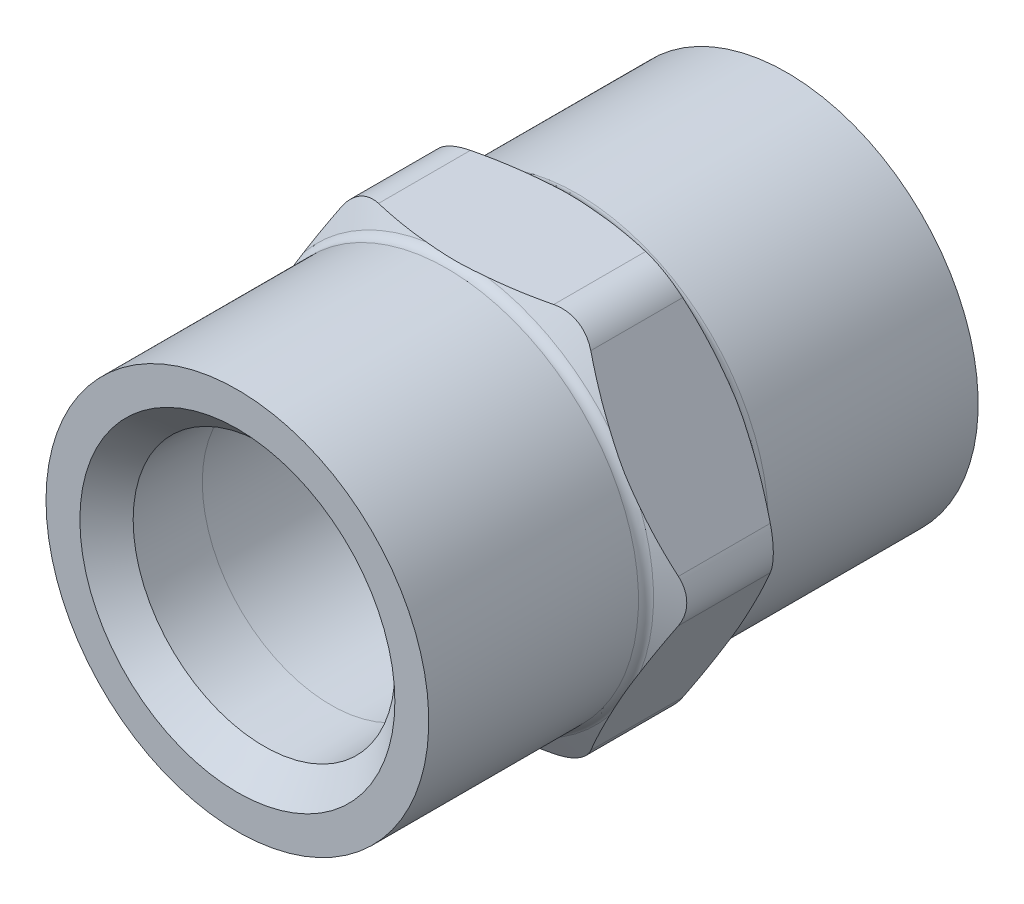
ISO-10303-21;
HEADER;
FILE_DESCRIPTION(('STEP AP214'),'2;1');
FILE_NAME('part.step','',(''),(''),'','','');
FILE_SCHEMA(('AUTOMOTIVE_DESIGN { 1 0 10303 214 1 1 1 1 }'));
ENDSEC;
DATA;
#1=APPLICATION_CONTEXT('core data for automotive mechanical design processes');
#2=APPLICATION_PROTOCOL_DEFINITION('international standard','automotive_design',2000,#1);
#3=PRODUCT_CONTEXT('',#1,'mechanical');
#4=PRODUCT('Part','Part','',(#3));
#5=PRODUCT_RELATED_PRODUCT_CATEGORY('part','',(#4));
#6=PRODUCT_DEFINITION_FORMATION('','',#4);
#7=PRODUCT_DEFINITION_CONTEXT('part definition',#1,'design');
#8=PRODUCT_DEFINITION('design','',#6,#7);
#9=PRODUCT_DEFINITION_SHAPE('','',#8);
#10=(LENGTH_UNIT() NAMED_UNIT(*) SI_UNIT(.MILLI.,.METRE.));
#11=(NAMED_UNIT(*) PLANE_ANGLE_UNIT() SI_UNIT($,.RADIAN.));
#12=(NAMED_UNIT(*) SI_UNIT($,.STERADIAN.) SOLID_ANGLE_UNIT());
#13=UNCERTAINTY_MEASURE_WITH_UNIT(LENGTH_MEASURE(1.E-05),#10,'distance_accuracy_value','');
#14=(GEOMETRIC_REPRESENTATION_CONTEXT(3) GLOBAL_UNCERTAINTY_ASSIGNED_CONTEXT((#13)) GLOBAL_UNIT_ASSIGNED_CONTEXT((#10,
#11,#12)) REPRESENTATION_CONTEXT('',''));
#15=CARTESIAN_POINT('',(0.,0.,0.));
#16=DIRECTION('',(0.,0.,1.));
#17=DIRECTION('',(1.,0.,0.));
#18=AXIS2_PLACEMENT_3D('',#15,#16,#17);
#19=CARTESIAN_POINT('',(6.0738241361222,10.520172,22.3636243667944));
#20=DIRECTION('',(0.,0.,-1.));
#21=DIRECTION('',(-1.,0.,0.));
#22=AXIS2_PLACEMENT_3D('',#19,#20,#21);
#23=CYLINDRICAL_SURFACE('',#22,2.967228);
#24=DIRECTION('',(0.,0.,1.));
#25=VECTOR('',#24,1.);
#26=CARTESIAN_POINT('',(6.0738241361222,13.4874,19.05));
#27=LINE('',#26,#25);
#28=CARTESIAN_POINT('',(6.0738241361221,13.4874,22.2361772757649));
#29=VERTEX_POINT('',#28);
#30=CARTESIAN_POINT('',(6.0738241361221,13.4874,15.8638227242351));
#31=VERTEX_POINT('',#30);
#32=EDGE_CURVE('E180',#29,#31,#27,.F.);
#33=ORIENTED_EDGE('',*,*,#32,.F.);
#34=CARTESIAN_POINT('',(8.64351896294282,12.0037859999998,22.2361772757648));
#35=CARTESIAN_POINT('',(8.6058031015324,12.0691293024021,22.2182881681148));
#36=CARTESIAN_POINT('',(8.56543732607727,12.1332719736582,22.2015751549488));
#37=CARTESIAN_POINT('',(8.47960052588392,12.2586900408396,22.1706069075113));
#38=CARTESIAN_POINT('',(8.43412835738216,12.3199647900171,22.1563522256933));
#39=CARTESIAN_POINT('',(8.33827646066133,12.439168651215,22.1304105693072));
#40=CARTESIAN_POINT('',(8.28789530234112,12.4970967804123,22.1187243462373));
#41=CARTESIAN_POINT('',(8.18255352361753,12.6091005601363,22.0980170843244));
#42=CARTESIAN_POINT('',(8.12759333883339,12.6631765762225,22.0889957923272));
#43=CARTESIAN_POINT('',(7.95611132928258,12.8191432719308,22.0660218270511));
#44=CARTESIAN_POINT('',(7.83307224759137,12.9146675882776,22.0561818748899));
#45=CARTESIAN_POINT('',(7.57340199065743,13.0852954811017,22.0478587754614));
#46=CARTESIAN_POINT('',(7.43677895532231,13.1604111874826,22.0493688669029));
#47=CARTESIAN_POINT('',(7.15717801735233,13.2867205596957,22.0634921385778));
#48=CARTESIAN_POINT('',(7.01441373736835,13.3384168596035,22.0758534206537));
#49=CARTESIAN_POINT('',(6.72389020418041,13.4192326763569,22.1109569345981));
#50=CARTESIAN_POINT('',(6.57613369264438,13.4483643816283,22.1336935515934));
#51=CARTESIAN_POINT('',(6.36894201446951,13.4732918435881,22.1722391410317));
#52=CARTESIAN_POINT('',(6.30974500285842,13.4786010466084,22.1840106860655));
#53=CARTESIAN_POINT('',(6.19159161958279,13.4856498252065,22.2090108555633));
#54=CARTESIAN_POINT('',(6.13263500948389,13.4873977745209,22.2222359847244));
#55=CARTESIAN_POINT('',(6.07382413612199,13.4874,22.2361772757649));
#56=B_SPLINE_CURVE_WITH_KNOTS('',3,(#34,#35,#36,#37,#38,#39,#40,#41,#42,#43,#44,#45,#46,#47,#48,
#49,#50,#51,#52,#53,#54,#55),.UNSPECIFIED.,.F.,.F.,(4,2,2,2,2,2,2,2,2,2,4),(0.,
0.232560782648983,0.465173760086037,0.697854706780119,0.930513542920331,1.39623550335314,
1.86168005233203,2.3165973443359,2.77126873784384,2.95294012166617,3.134183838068),.UNSPECIFIED.);
#57=CARTESIAN_POINT('',(8.64351896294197,12.0037859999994,22.2361772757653));
#58=VERTEX_POINT('',#57);
#59=EDGE_CURVE('E205',#58,#29,#56,.T.);
#60=ORIENTED_EDGE('',*,*,#59,.F.);
#61=DIRECTION('',(0.,0.,1.));
#62=VECTOR('',#61,1.);
#63=CARTESIAN_POINT('',(8.64351896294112,12.0037859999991,19.0499999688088));
#64=LINE('',#63,#62);
#65=CARTESIAN_POINT('',(8.64351896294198,12.0037859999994,15.8638227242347));
#66=VERTEX_POINT('',#65);
#67=EDGE_CURVE('E195',#66,#58,#64,.T.);
#68=ORIENTED_EDGE('',*,*,#67,.F.);
#69=CARTESIAN_POINT('',(6.07382413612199,13.4874,15.863822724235));
#70=CARTESIAN_POINT('',(6.14927102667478,13.4874087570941,15.8817118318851));
#71=CARTESIAN_POINT('',(6.22500309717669,13.4845223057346,15.8984248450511));
#72=CARTESIAN_POINT('',(6.37653672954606,13.4728944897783,15.9293930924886));
#73=CARTESIAN_POINT('',(6.45233830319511,13.4641518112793,15.9436477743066));
#74=CARTESIAN_POINT('',(6.6034978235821,13.4407435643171,15.9695894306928));
#75=CARTESIAN_POINT('',(6.67885563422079,13.4260762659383,15.9812756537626));
#76=CARTESIAN_POINT('',(6.82852464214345,13.3908494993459,16.0019829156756));
#77=CARTESIAN_POINT('',(6.90283593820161,13.3702905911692,16.0110042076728));
#78=CARTESIAN_POINT('',(7.12364806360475,13.2997661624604,16.0339781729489));
#79=CARTESIAN_POINT('',(7.2678940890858,13.2409733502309,16.0438181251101));
#80=CARTESIAN_POINT('',(7.5454973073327,13.1014062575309,16.0521412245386));
#81=CARTESIAN_POINT('',(7.67886093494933,13.020645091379,16.0506311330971));
#82=CARTESIAN_POINT('',(7.92804852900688,12.8416582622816,16.0365078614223));
#83=CARTESIAN_POINT('',(8.04420097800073,12.7438689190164,16.0241465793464));
#84=CARTESIAN_POINT('',(8.25945129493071,12.5326760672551,15.9890430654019));
#85=CARTESIAN_POINT('',(8.35855834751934,12.419281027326,15.9663064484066));
#86=CARTESIAN_POINT('',(8.48374200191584,12.2523115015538,15.9277608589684));
#87=CARTESIAN_POINT('',(8.51793841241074,12.2036999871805,15.9159893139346));
#88=CARTESIAN_POINT('',(8.58311952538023,12.1049005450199,15.8909891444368));
#89=CARTESIAN_POINT('',(8.6141115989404,12.0547165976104,15.8777640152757));
#90=CARTESIAN_POINT('',(8.64351896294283,12.0037859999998,15.8638227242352));
#91=B_SPLINE_CURVE_WITH_KNOTS('',3,(#69,#70,#71,#72,#73,#74,#75,#76,#77,#78,#79,#80,#81,#82,#83,
#84,#85,#86,#87,#88,#89,#90),.UNSPECIFIED.,.F.,.F.,(4,2,2,2,2,2,2,2,2,2,4),(0.,
0.232560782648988,0.465173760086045,0.697854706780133,0.93051354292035,1.39623550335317,
1.86168005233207,2.31659734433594,2.77126873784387,2.95294012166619,3.134183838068),.UNSPECIFIED.);
#92=EDGE_CURVE('E20',#31,#66,#91,.T.);
#93=ORIENTED_EDGE('',*,*,#92,.F.);
#94=EDGE_LOOP('',(#33,#60,#68,#93));
#95=FACE_BOUND('',#94,.T.);
#96=ADVANCED_FACE('F16',(#95),#23,.T.);
#97=CARTESIAN_POINT('',(12.1476482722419,0.,22.3636243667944));
#98=DIRECTION('',(0.,0.,-1.));
#99=DIRECTION('',(-1.,0.,0.));
#100=AXIS2_PLACEMENT_3D('',#97,#98,#99);
#101=CYLINDRICAL_SURFACE('',#100,2.967228);
#102=DIRECTION('',(0.,0.,1.));
#103=VECTOR('',#102,1.);
#104=CARTESIAN_POINT('',(14.717343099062,1.48361400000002,19.0499999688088));
#105=LINE('',#104,#103);
#106=CARTESIAN_POINT('',(14.7173430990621,1.48361400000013,22.2361772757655));
#107=VERTEX_POINT('',#106);
#108=CARTESIAN_POINT('',(14.7173430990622,1.48361399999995,15.8638227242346));
#109=VERTEX_POINT('',#108);
#110=EDGE_CURVE('E378',#107,#109,#105,.F.);
#111=ORIENTED_EDGE('',*,*,#110,.F.);
#112=CARTESIAN_POINT('',(14.7173430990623,-1.48361400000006,22.2361772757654));
#113=CARTESIAN_POINT('',(14.7550741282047,-1.41827945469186,22.2182881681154));
#114=CARTESIAN_POINT('',(14.7904404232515,-1.35125033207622,22.2015751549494));
#115=CARTESIAN_POINT('',(14.8561372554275,-1.21420444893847,22.1706069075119));
#116=CARTESIAN_POINT('',(14.8864666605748,-1.14418702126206,22.1563522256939));
#117=CARTESIAN_POINT('',(14.9417742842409,-1.00157491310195,22.1304105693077));
#118=CARTESIAN_POINT('',(14.9667509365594,-0.928979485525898,22.1187243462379));
#119=CARTESIAN_POINT('',(15.0110781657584,-0.781748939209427,22.0980170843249));
#120=CARTESIAN_POINT('',(15.0304292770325,-0.707114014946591,22.0889957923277));
#121=CARTESIAN_POINT('',(15.0797593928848,-0.480622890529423,22.0660218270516));
#122=CARTESIAN_POINT('',(15.1009663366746,-0.326305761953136,22.0561818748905));
#123=CARTESIAN_POINT('',(15.1188992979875,-0.0161107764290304,22.047858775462));
#124=CARTESIAN_POINT('',(15.115639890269,0.139766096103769,22.0493688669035));
#125=CARTESIAN_POINT('',(15.0852265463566,0.445062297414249,22.0634921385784));
#126=CARTESIAN_POINT('',(15.0586147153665,0.594547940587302,22.0758534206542));
#127=CARTESIAN_POINT('',(14.9833414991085,0.886556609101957,22.1109569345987));
#128=CARTESIAN_POINT('',(14.9346920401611,1.02908335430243,22.133693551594));
#129=CARTESIAN_POINT('',(14.8526840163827,1.22098034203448,22.1722391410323));
#130=CARTESIAN_POINT('',(14.8276834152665,1.2749010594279,22.184010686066));
#131=CARTESIAN_POINT('',(14.7747111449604,1.38074928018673,22.2090108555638));
#132=CARTESIAN_POINT('',(14.7467466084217,1.43268117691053,22.2222359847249));
#133=CARTESIAN_POINT('',(14.7173430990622,1.48361400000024,22.2361772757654));
#134=B_SPLINE_CURVE_WITH_KNOTS('',3,(#112,#113,#114,#115,#116,#117,#118,#119,#120,#121,#122,
#123,#124,#125,#126,#127,#128,#129,#130,#131,#132,#133),.UNSPECIFIED.,.F.,.F.,(4,2,2,2,2,2,2,2,
2,2,4),(0.,0.232560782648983,0.465173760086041,0.697854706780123,0.930513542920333,
1.39623550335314,1.86168005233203,2.3165973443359,2.77126873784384,2.9529401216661,
3.13418383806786),.UNSPECIFIED.);
#135=CARTESIAN_POINT('',(14.7173430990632,-1.4836140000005,22.2361772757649));
#136=VERTEX_POINT('',#135);
#137=EDGE_CURVE('E244',#136,#107,#134,.T.);
#138=ORIENTED_EDGE('',*,*,#137,.F.);
#139=DIRECTION('',(0.,0.,1.));
#140=VECTOR('',#139,1.);
#141=CARTESIAN_POINT('',(14.717343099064,-1.48361400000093,19.0500000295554));
#142=LINE('',#141,#140);
#143=CARTESIAN_POINT('',(14.7173430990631,-1.48361400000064,15.863822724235));
#144=VERTEX_POINT('',#143);
#145=EDGE_CURVE('E376',#144,#136,#142,.T.);
#146=ORIENTED_EDGE('',*,*,#145,.F.);
#147=CARTESIAN_POINT('',(14.7173430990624,1.48361399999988,15.8638227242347));
#148=CARTESIAN_POINT('',(14.7550741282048,1.41827945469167,15.8817118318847));
#149=CARTESIAN_POINT('',(14.7904404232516,1.35125033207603,15.8984248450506));
#150=CARTESIAN_POINT('',(14.8561372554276,1.21420444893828,15.9293930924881));
#151=CARTESIAN_POINT('',(14.8864666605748,1.14418702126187,15.9436477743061));
#152=CARTESIAN_POINT('',(14.941774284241,1.00157491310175,15.9695894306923));
#153=CARTESIAN_POINT('',(14.9667509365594,0.9289794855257,15.9812756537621));
#154=CARTESIAN_POINT('',(15.0110781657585,0.781748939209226,16.0019829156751));
#155=CARTESIAN_POINT('',(15.0304292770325,0.707114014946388,16.0110042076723));
#156=CARTESIAN_POINT('',(15.0797593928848,0.480622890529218,16.0339781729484));
#157=CARTESIAN_POINT('',(15.1009663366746,0.32630576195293,16.0438181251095));
#158=CARTESIAN_POINT('',(15.1188992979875,0.0161107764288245,16.052141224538));
#159=CARTESIAN_POINT('',(15.115639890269,-0.139766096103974,16.0506311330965));
#160=CARTESIAN_POINT('',(15.0852265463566,-0.445062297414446,16.0365078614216));
#161=CARTESIAN_POINT('',(15.0586147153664,-0.594547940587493,16.0241465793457));
#162=CARTESIAN_POINT('',(14.9833414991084,-0.886556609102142,15.9890430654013));
#163=CARTESIAN_POINT('',(14.934692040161,-1.02908335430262,15.966306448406));
#164=CARTESIAN_POINT('',(14.8526840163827,-1.2209803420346,15.9277608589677));
#165=CARTESIAN_POINT('',(14.8276834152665,-1.27490105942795,15.915989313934));
#166=CARTESIAN_POINT('',(14.7747111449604,-1.38074928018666,15.8909891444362));
#167=CARTESIAN_POINT('',(14.7467466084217,-1.4326811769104,15.8777640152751));
#168=CARTESIAN_POINT('',(14.7173430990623,-1.48361400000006,15.8638227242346));
#169=B_SPLINE_CURVE_WITH_KNOTS('',3,(#147,#148,#149,#150,#151,#152,#153,#154,#155,#156,#157,
#158,#159,#160,#161,#162,#163,#164,#165,#166,#167,#168),.UNSPECIFIED.,.F.,.F.,(4,2,2,2,2,2,2,2,
2,2,4),(0.,0.232560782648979,0.465173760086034,0.697854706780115,0.930513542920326,
1.39623550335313,1.86168005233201,2.31659734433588,2.77126873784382,2.95294012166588,
3.13418383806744),.UNSPECIFIED.);
#170=EDGE_CURVE('E898',#109,#144,#169,.T.);
#171=ORIENTED_EDGE('',*,*,#170,.F.);
#172=EDGE_LOOP('',(#111,#138,#146,#171));
#173=FACE_BOUND('',#172,.T.);
#174=ADVANCED_FACE('F900',(#173),#101,.T.);
#175=CARTESIAN_POINT('',(6.0738241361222,-10.520172,22.3636243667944));
#176=DIRECTION('',(0.,0.,-1.));
#177=DIRECTION('',(-1.,0.,0.));
#178=AXIS2_PLACEMENT_3D('',#175,#176,#177);
#179=CYLINDRICAL_SURFACE('',#178,2.967228);
#180=DIRECTION('',(0.,0.,1.));
#181=VECTOR('',#180,1.);
#182=CARTESIAN_POINT('',(8.64351896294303,-12.0037860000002,19.0500000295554));
#183=LINE('',#182,#181);
#184=CARTESIAN_POINT('',(8.64351896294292,-12.003786,22.2361772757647));
#185=VERTEX_POINT('',#184);
#186=CARTESIAN_POINT('',(8.64351896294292,-12.003786,15.8638227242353));
#187=VERTEX_POINT('',#186);
#188=EDGE_CURVE('E372',#185,#187,#183,.F.);
#189=ORIENTED_EDGE('',*,*,#188,.F.);
#190=CARTESIAN_POINT('',(6.07382413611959,-13.4874,22.2361772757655));
#191=CARTESIAN_POINT('',(6.14927102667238,-13.4874087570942,22.2182881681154));
#192=CARTESIAN_POINT('',(6.2250030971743,-13.4845223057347,22.2015751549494));
#193=CARTESIAN_POINT('',(6.37653672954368,-13.4728944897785,22.1706069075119));
#194=CARTESIAN_POINT('',(6.45233830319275,-13.4641518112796,22.1563522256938));
#195=CARTESIAN_POINT('',(6.60349782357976,-13.4407435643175,22.1304105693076));
#196=CARTESIAN_POINT('',(6.67885563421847,-13.4260762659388,22.1187243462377));
#197=CARTESIAN_POINT('',(6.82852464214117,-13.3908494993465,22.0980170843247));
#198=CARTESIAN_POINT('',(6.90283593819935,-13.3702905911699,22.0889957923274));
#199=CARTESIAN_POINT('',(7.12364806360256,-13.2997661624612,22.0660218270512));
#200=CARTESIAN_POINT('',(7.26789408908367,-13.2409733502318,22.05618187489));
#201=CARTESIAN_POINT('',(7.5454973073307,-13.101406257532,22.0478587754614));
#202=CARTESIAN_POINT('',(7.67886093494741,-13.0206450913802,22.0493688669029));
#203=CARTESIAN_POINT('',(7.92804852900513,-12.841658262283,22.0634921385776));
#204=CARTESIAN_POINT('',(8.04420097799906,-12.7438689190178,22.0758534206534));
#205=CARTESIAN_POINT('',(8.25945129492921,-12.5326760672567,22.1109569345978));
#206=CARTESIAN_POINT('',(8.35855834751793,-12.4192810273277,22.133693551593));
#207=CARTESIAN_POINT('',(8.48374200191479,-12.2523115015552,22.1722391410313));
#208=CARTESIAN_POINT('',(8.51793841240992,-12.2036999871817,22.1840106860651));
#209=CARTESIAN_POINT('',(8.58311952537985,-12.1049005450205,22.209010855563));
#210=CARTESIAN_POINT('',(8.61411159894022,-12.0547165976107,22.2222359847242));
#211=CARTESIAN_POINT('',(8.64351896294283,-12.0037859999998,22.2361772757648));
#212=B_SPLINE_CURVE_WITH_KNOTS('',3,(#190,#191,#192,#193,#194,#195,#196,#197,#198,#199,#200,
#201,#202,#203,#204,#205,#206,#207,#208,#209,#210,#211),.UNSPECIFIED.,.F.,.F.,(4,2,2,2,2,2,2,2,
2,2,4),(0.,0.232560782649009,0.465173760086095,0.697854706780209,0.930513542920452,
1.39623550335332,1.86168005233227,2.31659734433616,2.77126873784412,2.95294012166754,
3.13418383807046),.UNSPECIFIED.);
#213=CARTESIAN_POINT('',(6.07382413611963,-13.4874,22.2361772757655));
#214=VERTEX_POINT('',#213);
#215=EDGE_CURVE('E832',#214,#185,#212,.T.);
#216=ORIENTED_EDGE('',*,*,#215,.F.);
#217=DIRECTION('',(0.,0.,1.));
#218=VECTOR('',#217,1.);
#219=CARTESIAN_POINT('',(6.07382413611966,-13.4874,19.0500000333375));
#220=LINE('',#219,#218);
#221=CARTESIAN_POINT('',(6.07382413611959,-13.4874,15.8638227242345));
#222=VERTEX_POINT('',#221);
#223=EDGE_CURVE('E363',#214,#222,#220,.F.);
#224=ORIENTED_EDGE('',*,*,#223,.T.);
#225=CARTESIAN_POINT('',(8.64351896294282,-12.0037859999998,15.8638227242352));
#226=CARTESIAN_POINT('',(8.6058031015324,-12.0691293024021,15.8817118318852));
#227=CARTESIAN_POINT('',(8.56543732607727,-12.1332719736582,15.8984248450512));
#228=CARTESIAN_POINT('',(8.47960052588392,-12.2586900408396,15.9293930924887));
#229=CARTESIAN_POINT('',(8.43412835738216,-12.3199647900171,15.9436477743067));
#230=CARTESIAN_POINT('',(8.33827646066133,-12.439168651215,15.9695894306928));
#231=CARTESIAN_POINT('',(8.28789530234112,-12.4970967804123,15.9812756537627));
#232=CARTESIAN_POINT('',(8.18255352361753,-12.6091005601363,16.0019829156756));
#233=CARTESIAN_POINT('',(8.12759333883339,-12.6631765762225,16.0110042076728));
#234=CARTESIAN_POINT('',(7.95611132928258,-12.8191432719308,16.0339781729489));
#235=CARTESIAN_POINT('',(7.83307224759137,-12.9146675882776,16.0438181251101));
#236=CARTESIAN_POINT('',(7.57340199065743,-13.0852954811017,16.0521412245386));
#237=CARTESIAN_POINT('',(7.43677895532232,-13.1604111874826,16.0506311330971));
#238=CARTESIAN_POINT('',(7.15717801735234,-13.2867205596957,16.0365078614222));
#239=CARTESIAN_POINT('',(7.01441373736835,-13.3384168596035,16.0241465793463));
#240=CARTESIAN_POINT('',(6.72389020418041,-13.4192326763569,15.9890430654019));
#241=CARTESIAN_POINT('',(6.57613369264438,-13.4483643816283,15.9663064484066));
#242=CARTESIAN_POINT('',(6.36894201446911,-13.4732918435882,15.9277608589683));
#243=CARTESIAN_POINT('',(6.30974500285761,-13.4786010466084,15.9159893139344));
#244=CARTESIAN_POINT('',(6.19159161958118,-13.4856498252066,15.8909891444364));
#245=CARTESIAN_POINT('',(6.13263500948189,-13.4873977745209,15.8777640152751));
#246=CARTESIAN_POINT('',(6.07382413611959,-13.4874,15.8638227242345));
#247=B_SPLINE_CURVE_WITH_KNOTS('',3,(#225,#226,#227,#228,#229,#230,#231,#232,#233,#234,#235,
#236,#237,#238,#239,#240,#241,#242,#243,#244,#245,#246),.UNSPECIFIED.,.F.,.F.,(4,2,2,2,2,2,2,2,
2,2,4),(0.,0.232560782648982,0.465173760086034,0.697854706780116,0.930513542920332,
1.39623550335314,1.86168005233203,2.3165973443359,2.77126873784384,2.9529401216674,
3.13418383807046),.UNSPECIFIED.);
#248=EDGE_CURVE('E793',#187,#222,#247,.T.);
#249=ORIENTED_EDGE('',*,*,#248,.F.);
#250=EDGE_LOOP('',(#189,#216,#224,#249));
#251=FACE_BOUND('',#250,.T.);
#252=ADVANCED_FACE('F777',(#251),#179,.T.);
#253=CARTESIAN_POINT('',(-6.0738241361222,-10.520172,22.3636243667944));
#254=DIRECTION('',(0.,0.,-1.));
#255=DIRECTION('',(-1.,0.,0.));
#256=AXIS2_PLACEMENT_3D('',#253,#254,#255);
#257=CYLINDRICAL_SURFACE('',#256,2.967228);
#258=DIRECTION('',(0.,0.,1.));
#259=VECTOR('',#258,1.);
#260=CARTESIAN_POINT('',(-6.0738241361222,-13.4874,19.0500000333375));
#261=LINE('',#260,#259);
#262=CARTESIAN_POINT('',(-6.0738241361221,-13.4874,15.8638227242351));
#263=VERTEX_POINT('',#262);
#264=CARTESIAN_POINT('',(-6.0738241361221,-13.4874,22.2361772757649));
#265=VERTEX_POINT('',#264);
#266=EDGE_CURVE('E368',#263,#265,#261,.T.);
#267=ORIENTED_EDGE('',*,*,#266,.T.);
#268=CARTESIAN_POINT('',(-8.64351896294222,-12.0037860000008,22.2361772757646));
#269=CARTESIAN_POINT('',(-8.60580310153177,-12.0691293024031,22.2182881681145));
#270=CARTESIAN_POINT('',(-8.56543732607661,-12.1332719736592,22.2015751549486));
#271=CARTESIAN_POINT('',(-8.47960052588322,-12.2586900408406,22.1706069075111));
#272=CARTESIAN_POINT('',(-8.43412835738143,-12.319964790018,22.1563522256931));
#273=CARTESIAN_POINT('',(-8.33827646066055,-12.4391686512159,22.130410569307));
#274=CARTESIAN_POINT('',(-8.28789530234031,-12.4970967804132,22.1187243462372));
#275=CARTESIAN_POINT('',(-8.18255352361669,-12.6091005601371,22.0980170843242));
#276=CARTESIAN_POINT('',(-8.12759333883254,-12.6631765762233,22.088995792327));
#277=CARTESIAN_POINT('',(-7.95611132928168,-12.8191432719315,22.0660218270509));
#278=CARTESIAN_POINT('',(-7.83307224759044,-12.9146675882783,22.0561818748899));
#279=CARTESIAN_POINT('',(-7.57340199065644,-13.0852954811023,22.0478587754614));
#280=CARTESIAN_POINT('',(-7.4367789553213,-13.1604111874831,22.0493688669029));
#281=CARTESIAN_POINT('',(-7.15717801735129,-13.2867205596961,22.0634921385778));
#282=CARTESIAN_POINT('',(-7.01441373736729,-13.3384168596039,22.0758534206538));
#283=CARTESIAN_POINT('',(-6.72389020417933,-13.4192326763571,22.1109569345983));
#284=CARTESIAN_POINT('',(-6.5761336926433,-13.4483643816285,22.1336935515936));
#285=CARTESIAN_POINT('',(-6.36894201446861,-13.4732918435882,22.1722391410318));
#286=CARTESIAN_POINT('',(-6.3097450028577,-13.4786010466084,22.1840106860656));
#287=CARTESIAN_POINT('',(-6.19159161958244,-13.4856498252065,22.2090108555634));
#288=CARTESIAN_POINT('',(-6.13263500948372,-13.4873977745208,22.2222359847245));
#289=CARTESIAN_POINT('',(-6.07382413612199,-13.4874,22.2361772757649));
#290=B_SPLINE_CURVE_WITH_KNOTS('',3,(#268,#269,#270,#271,#272,#273,#274,#275,#276,#277,#278,
#279,#280,#281,#282,#283,#284,#285,#286,#287,#288,#289),.UNSPECIFIED.,.F.,.F.,(4,2,2,2,2,2,2,2,
2,2,4),(0.,0.23256078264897,0.465173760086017,0.697854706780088,0.930513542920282,
1.39623550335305,1.86168005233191,2.31659734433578,2.77126873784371,2.95294012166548,
3.13418383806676),.UNSPECIFIED.);
#291=CARTESIAN_POINT('',(-8.64351896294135,-12.0037860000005,22.236177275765));
#292=VERTEX_POINT('',#291);
#293=EDGE_CURVE('E366',#292,#265,#290,.T.);
#294=ORIENTED_EDGE('',*,*,#293,.F.);
#295=DIRECTION('',(0.,0.,1.));
#296=VECTOR('',#295,1.);
#297=CARTESIAN_POINT('',(-8.64351896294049,-12.0037860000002,19.0499999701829));
#298=LINE('',#297,#296);
#299=CARTESIAN_POINT('',(-8.64351896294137,-12.0037860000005,15.863822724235));
#300=VERTEX_POINT('',#299);
#301=EDGE_CURVE('E355',#292,#300,#298,.F.);
#302=ORIENTED_EDGE('',*,*,#301,.T.);
#303=CARTESIAN_POINT('',(-6.07382413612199,-13.4874,15.863822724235));
#304=CARTESIAN_POINT('',(-6.14927102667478,-13.4874087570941,15.8817118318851));
#305=CARTESIAN_POINT('',(-6.22500309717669,-13.4845223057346,15.8984248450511));
#306=CARTESIAN_POINT('',(-6.37653672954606,-13.4728944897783,15.9293930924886));
#307=CARTESIAN_POINT('',(-6.45233830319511,-13.4641518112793,15.9436477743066));
#308=CARTESIAN_POINT('',(-6.6034978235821,-13.4407435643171,15.9695894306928));
#309=CARTESIAN_POINT('',(-6.67885563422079,-13.4260762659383,15.9812756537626));
#310=CARTESIAN_POINT('',(-6.82852464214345,-13.3908494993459,16.0019829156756));
#311=CARTESIAN_POINT('',(-6.90283593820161,-13.3702905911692,16.0110042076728));
#312=CARTESIAN_POINT('',(-7.12364806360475,-13.2997661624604,16.0339781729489));
#313=CARTESIAN_POINT('',(-7.2678940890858,-13.2409733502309,16.0438181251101));
#314=CARTESIAN_POINT('',(-7.5454973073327,-13.1014062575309,16.0521412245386));
#315=CARTESIAN_POINT('',(-7.67886093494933,-13.020645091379,16.0506311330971));
#316=CARTESIAN_POINT('',(-7.92804852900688,-12.8416582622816,16.0365078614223));
#317=CARTESIAN_POINT('',(-8.04420097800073,-12.7438689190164,16.0241465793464));
#318=CARTESIAN_POINT('',(-8.25945129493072,-12.5326760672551,15.9890430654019));
#319=CARTESIAN_POINT('',(-8.35855834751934,-12.419281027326,15.9663064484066));
#320=CARTESIAN_POINT('',(-8.48374200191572,-12.2523115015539,15.9277608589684));
#321=CARTESIAN_POINT('',(-8.51793841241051,-12.2036999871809,15.9159893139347));
#322=CARTESIAN_POINT('',(-8.58311952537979,-12.1049005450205,15.890989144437));
#323=CARTESIAN_POINT('',(-8.61411159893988,-12.0547165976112,15.8777640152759));
#324=CARTESIAN_POINT('',(-8.64351896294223,-12.0037860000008,15.8638227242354));
#325=B_SPLINE_CURVE_WITH_KNOTS('',3,(#303,#304,#305,#306,#307,#308,#309,#310,#311,#312,#313,
#314,#315,#316,#317,#318,#319,#320,#321,#322,#323,#324),.UNSPECIFIED.,.F.,.F.,(4,2,2,2,2,2,2,2,
2,2,4),(0.,0.232560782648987,0.465173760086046,0.697854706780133,0.93051354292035,
1.39623550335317,1.86168005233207,2.31659734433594,2.77126873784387,2.95294012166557,
3.13418383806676),.UNSPECIFIED.);
#326=EDGE_CURVE('E788',#263,#300,#325,.T.);
#327=ORIENTED_EDGE('',*,*,#326,.F.);
#328=EDGE_LOOP('',(#267,#294,#302,#327));
#329=FACE_BOUND('',#328,.T.);
#330=ADVANCED_FACE('F771',(#329),#257,.T.);
#331=CARTESIAN_POINT('',(-6.0738241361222,10.520172,22.3636243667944));
#332=DIRECTION('',(0.,0.,-1.));
#333=DIRECTION('',(-1.,0.,0.));
#334=AXIS2_PLACEMENT_3D('',#331,#332,#333);
#335=CYLINDRICAL_SURFACE('',#334,2.967228);
#336=DIRECTION('',(0.,0.,1.));
#337=VECTOR('',#336,1.);
#338=CARTESIAN_POINT('',(-8.64351896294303,12.0037860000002,19.05));
#339=LINE('',#338,#337);
#340=CARTESIAN_POINT('',(-8.64351896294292,12.003786,15.8638227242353));
#341=VERTEX_POINT('',#340);
#342=CARTESIAN_POINT('',(-8.64351896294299,12.0037859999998,22.2361772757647));
#343=VERTEX_POINT('',#342);
#344=EDGE_CURVE('E350',#341,#343,#339,.T.);
#345=ORIENTED_EDGE('',*,*,#344,.T.);
#346=CARTESIAN_POINT('',(-6.07382413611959,13.4874,22.2361772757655));
#347=CARTESIAN_POINT('',(-6.14927102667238,13.4874087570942,22.2182881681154));
#348=CARTESIAN_POINT('',(-6.2250030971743,13.4845223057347,22.2015751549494));
#349=CARTESIAN_POINT('',(-6.37653672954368,13.4728944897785,22.1706069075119));
#350=CARTESIAN_POINT('',(-6.45233830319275,13.4641518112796,22.1563522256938));
#351=CARTESIAN_POINT('',(-6.60349782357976,13.4407435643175,22.1304105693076));
#352=CARTESIAN_POINT('',(-6.67885563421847,13.4260762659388,22.1187243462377));
#353=CARTESIAN_POINT('',(-6.82852464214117,13.3908494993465,22.0980170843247));
#354=CARTESIAN_POINT('',(-6.90283593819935,13.3702905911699,22.0889957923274));
#355=CARTESIAN_POINT('',(-7.12364806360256,13.2997661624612,22.0660218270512));
#356=CARTESIAN_POINT('',(-7.26789408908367,13.2409733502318,22.05618187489));
#357=CARTESIAN_POINT('',(-7.5454973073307,13.101406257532,22.0478587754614));
#358=CARTESIAN_POINT('',(-7.67886093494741,13.0206450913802,22.0493688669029));
#359=CARTESIAN_POINT('',(-7.92804852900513,12.841658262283,22.0634921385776));
#360=CARTESIAN_POINT('',(-8.04420097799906,12.7438689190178,22.0758534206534));
#361=CARTESIAN_POINT('',(-8.25945129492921,12.5326760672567,22.1109569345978));
#362=CARTESIAN_POINT('',(-8.35855834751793,12.4192810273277,22.133693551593));
#363=CARTESIAN_POINT('',(-8.48374200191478,12.2523115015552,22.1722391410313));
#364=CARTESIAN_POINT('',(-8.51793841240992,12.2036999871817,22.1840106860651));
#365=CARTESIAN_POINT('',(-8.58311952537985,12.1049005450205,22.209010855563));
#366=CARTESIAN_POINT('',(-8.61411159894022,12.0547165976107,22.2222359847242));
#367=CARTESIAN_POINT('',(-8.64351896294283,12.0037859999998,22.2361772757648));
#368=B_SPLINE_CURVE_WITH_KNOTS('',3,(#346,#347,#348,#349,#350,#351,#352,#353,#354,#355,#356,
#357,#358,#359,#360,#361,#362,#363,#364,#365,#366,#367),.UNSPECIFIED.,.F.,.F.,(4,2,2,2,2,2,2,2,
2,2,4),(0.,0.23256078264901,0.465173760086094,0.697854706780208,0.930513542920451,
1.39623550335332,1.86168005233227,2.31659734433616,2.77126873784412,2.95294012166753,
3.13418383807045),.UNSPECIFIED.);
#369=CARTESIAN_POINT('',(-6.07382413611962,13.4874,22.2361772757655));
#370=VERTEX_POINT('',#369);
#371=EDGE_CURVE('E384',#370,#343,#368,.T.);
#372=ORIENTED_EDGE('',*,*,#371,.F.);
#373=DIRECTION('',(0.,0.,1.));
#374=VECTOR('',#373,1.);
#375=CARTESIAN_POINT('',(-6.07382413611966,13.4874,19.05));
#376=LINE('',#375,#374);
#377=CARTESIAN_POINT('',(-6.07382413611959,13.4874,15.8638227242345));
#378=VERTEX_POINT('',#377);
#379=EDGE_CURVE('E382',#378,#370,#376,.T.);
#380=ORIENTED_EDGE('',*,*,#379,.F.);
#381=CARTESIAN_POINT('',(-8.64351896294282,12.0037859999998,15.8638227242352));
#382=CARTESIAN_POINT('',(-8.6058031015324,12.0691293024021,15.8817118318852));
#383=CARTESIAN_POINT('',(-8.56543732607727,12.1332719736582,15.8984248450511));
#384=CARTESIAN_POINT('',(-8.47960052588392,12.2586900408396,15.9293930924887));
#385=CARTESIAN_POINT('',(-8.43412835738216,12.3199647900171,15.9436477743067));
#386=CARTESIAN_POINT('',(-8.33827646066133,12.439168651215,15.9695894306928));
#387=CARTESIAN_POINT('',(-8.28789530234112,12.4970967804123,15.9812756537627));
#388=CARTESIAN_POINT('',(-8.18255352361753,12.6091005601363,16.0019829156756));
#389=CARTESIAN_POINT('',(-8.12759333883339,12.6631765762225,16.0110042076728));
#390=CARTESIAN_POINT('',(-7.95611132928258,12.8191432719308,16.0339781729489));
#391=CARTESIAN_POINT('',(-7.83307224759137,12.9146675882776,16.0438181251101));
#392=CARTESIAN_POINT('',(-7.57340199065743,13.0852954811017,16.0521412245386));
#393=CARTESIAN_POINT('',(-7.43677895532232,13.1604111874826,16.0506311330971));
#394=CARTESIAN_POINT('',(-7.15717801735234,13.2867205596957,16.0365078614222));
#395=CARTESIAN_POINT('',(-7.01441373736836,13.3384168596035,16.0241465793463));
#396=CARTESIAN_POINT('',(-6.72389020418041,13.4192326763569,15.9890430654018));
#397=CARTESIAN_POINT('',(-6.57613369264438,13.4483643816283,15.9663064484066));
#398=CARTESIAN_POINT('',(-6.36894201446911,13.4732918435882,15.9277608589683));
#399=CARTESIAN_POINT('',(-6.30974500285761,13.4786010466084,15.9159893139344));
#400=CARTESIAN_POINT('',(-6.19159161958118,13.4856498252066,15.8909891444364));
#401=CARTESIAN_POINT('',(-6.13263500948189,13.4873977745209,15.8777640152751));
#402=CARTESIAN_POINT('',(-6.07382413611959,13.4874,15.8638227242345));
#403=B_SPLINE_CURVE_WITH_KNOTS('',3,(#381,#382,#383,#384,#385,#386,#387,#388,#389,#390,#391,
#392,#393,#394,#395,#396,#397,#398,#399,#400,#401,#402),.UNSPECIFIED.,.F.,.F.,(4,2,2,2,2,2,2,2,
2,2,4),(0.,0.23256078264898,0.465173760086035,0.697854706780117,0.930513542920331,
1.39623550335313,1.86168005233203,2.3165973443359,2.77126873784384,2.9529401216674,
3.13418383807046),.UNSPECIFIED.);
#404=EDGE_CURVE('E762',#341,#378,#403,.T.);
#405=ORIENTED_EDGE('',*,*,#404,.F.);
#406=EDGE_LOOP('',(#345,#372,#380,#405));
#407=FACE_BOUND('',#406,.T.);
#408=ADVANCED_FACE('F767',(#407),#335,.T.);
#409=CARTESIAN_POINT('',(-12.1476482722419,0.,22.3636243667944));
#410=DIRECTION('',(0.,0.,-1.));
#411=DIRECTION('',(-1.,0.,0.));
#412=AXIS2_PLACEMENT_3D('',#409,#410,#411);
#413=CYLINDRICAL_SURFACE('',#412,2.967228);
#414=DIRECTION('',(0.,0.,1.));
#415=VECTOR('',#414,1.);
#416=CARTESIAN_POINT('',(-14.7173430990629,-1.4836139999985,19.0499999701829));
#417=LINE('',#416,#415);
#418=CARTESIAN_POINT('',(-14.717343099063,-1.48361399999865,15.8638227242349));
#419=VERTEX_POINT('',#418);
#420=CARTESIAN_POINT('',(-14.717342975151,-1.48361421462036,22.2361773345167));
#421=VERTEX_POINT('',#420);
#422=EDGE_CURVE('E360',#419,#421,#417,.T.);
#423=ORIENTED_EDGE('',*,*,#422,.T.);
#424=CARTESIAN_POINT('',(-14.7173430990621,1.48361400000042,22.2361772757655));
#425=CARTESIAN_POINT('',(-14.7550741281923,1.41827945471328,22.2182881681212));
#426=CARTESIAN_POINT('',(-14.7904404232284,1.35125033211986,22.2015751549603));
#427=CARTESIAN_POINT('',(-14.8561372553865,1.21420444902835,22.1706069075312));
#428=CARTESIAN_POINT('',(-14.8864666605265,1.14418702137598,22.1563522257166));
#429=CARTESIAN_POINT('',(-14.9417742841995,1.00157491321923,22.1304105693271));
#430=CARTESIAN_POINT('',(-14.9667509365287,0.928979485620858,22.1187243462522));
#431=CARTESIAN_POINT('',(-15.0110781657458,0.781748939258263,22.0980170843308));
#432=CARTESIAN_POINT('',(-15.0304292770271,0.707114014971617,22.0889957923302));
#433=CARTESIAN_POINT('',(-15.0797593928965,0.480622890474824,22.0660218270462));
#434=CARTESIAN_POINT('',(-15.1009663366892,0.326305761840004,22.0561818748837));
#435=CARTESIAN_POINT('',(-15.1188992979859,0.0161107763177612,22.0478587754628));
#436=CARTESIAN_POINT('',(-15.115639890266,-0.139766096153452,22.0493688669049));
#437=CARTESIAN_POINT('',(-15.0852265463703,-0.445062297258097,22.063492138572));
#438=CARTESIAN_POINT('',(-15.0586147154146,-0.594547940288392,22.0758534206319));
#439=CARTESIAN_POINT('',(-14.9833414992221,-0.886556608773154,22.1109569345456));
#440=CARTESIAN_POINT('',(-14.9346920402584,-1.02908335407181,22.1336935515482));
#441=CARTESIAN_POINT('',(-14.8526839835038,-1.22098041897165,22.1722391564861));
#442=CARTESIAN_POINT('',(-14.827683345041,-1.2749012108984,22.1840107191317));
#443=CARTESIAN_POINT('',(-14.7747109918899,-1.38074957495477,22.2090109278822));
#444=CARTESIAN_POINT('',(-14.7467464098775,-1.4326815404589,22.2222360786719));
#445=CARTESIAN_POINT('',(-14.7173428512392,-1.48361442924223,22.2361773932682));
#446=B_SPLINE_CURVE_WITH_KNOTS('',3,(#424,#425,#426,#427,#428,#429,#430,#431,#432,#433,#434,
#435,#436,#437,#438,#439,#440,#441,#442,#443,#444,#445),.UNSPECIFIED.,.F.,.F.,(4,2,2,2,2,2,2,2,
2,2,4),(0.,0.232560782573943,0.46517375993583,0.697854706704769,0.930513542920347,
1.39623550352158,1.86168005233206,2.3165973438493,2.77126873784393,2.95294037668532,
3.13418434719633),.UNSPECIFIED.);
#447=CARTESIAN_POINT('',(-14.7173430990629,1.48361400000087,22.236177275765));
#448=VERTEX_POINT('',#447);
#449=EDGE_CURVE('E742',#448,#421,#446,.T.);
#450=ORIENTED_EDGE('',*,*,#449,.F.);
#451=DIRECTION('',(0.,0.,1.));
#452=VECTOR('',#451,1.);
#453=CARTESIAN_POINT('',(-14.7173430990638,1.48361400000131,19.05));
#454=LINE('',#453,#452);
#455=CARTESIAN_POINT('',(-14.7173430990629,1.48361400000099,15.863822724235));
#456=VERTEX_POINT('',#455);
#457=EDGE_CURVE('E292',#448,#456,#454,.F.);
#458=ORIENTED_EDGE('',*,*,#457,.T.);
#459=CARTESIAN_POINT('',(-14.717343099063,-1.48361399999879,15.863822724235));
#460=CARTESIAN_POINT('',(-14.7550741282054,-1.41827945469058,15.881711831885));
#461=CARTESIAN_POINT('',(-14.7904404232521,-1.35125033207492,15.8984248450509));
#462=CARTESIAN_POINT('',(-14.8561372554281,-1.21420444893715,15.9293930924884));
#463=CARTESIAN_POINT('',(-14.8864666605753,-1.14418702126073,15.9436477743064));
#464=CARTESIAN_POINT('',(-14.9417742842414,-1.00157491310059,15.9695894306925));
#465=CARTESIAN_POINT('',(-14.9667509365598,-0.928979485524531,15.9812756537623));
#466=CARTESIAN_POINT('',(-15.0110781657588,-0.781748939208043,16.0019829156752));
#467=CARTESIAN_POINT('',(-15.0304292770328,-0.707114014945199,16.0110042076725));
#468=CARTESIAN_POINT('',(-15.079759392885,-0.480622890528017,16.0339781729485));
#469=CARTESIAN_POINT('',(-15.1009663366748,-0.326305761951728,16.0438181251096));
#470=CARTESIAN_POINT('',(-15.1188992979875,-0.0161107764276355,16.052141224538));
#471=CARTESIAN_POINT('',(-15.115639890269,0.13976609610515,16.0506311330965));
#472=CARTESIAN_POINT('',(-15.0852265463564,0.445062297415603,16.0365078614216));
#473=CARTESIAN_POINT('',(-15.0586147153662,0.594547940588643,16.0241465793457));
#474=CARTESIAN_POINT('',(-14.9833414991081,0.886556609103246,15.9890430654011));
#475=CARTESIAN_POINT('',(-14.9346920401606,1.02908335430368,15.9663064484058));
#476=CARTESIAN_POINT('',(-14.8526840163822,1.22098034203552,15.9277608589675));
#477=CARTESIAN_POINT('',(-14.8276834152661,1.27490105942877,15.9159893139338));
#478=CARTESIAN_POINT('',(-14.7747111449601,1.38074928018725,15.8909891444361));
#479=CARTESIAN_POINT('',(-14.7467466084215,1.43268117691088,15.877764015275));
#480=CARTESIAN_POINT('',(-14.7173430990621,1.48361400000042,15.8638227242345));
#481=B_SPLINE_CURVE_WITH_KNOTS('',3,(#459,#460,#461,#462,#463,#464,#465,#466,#467,#468,#469,
#470,#471,#472,#473,#474,#475,#476,#477,#478,#479,#480),.UNSPECIFIED.,.F.,.F.,(4,2,2,2,2,2,2,2,
2,2,4),(0.,0.232560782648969,0.465173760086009,0.697854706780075,0.930513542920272,
1.39623550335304,1.8616800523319,2.31659734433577,2.7712687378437,2.95294012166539,
3.13418383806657),.UNSPECIFIED.);
#482=EDGE_CURVE('E198',#419,#456,#481,.T.);
#483=ORIENTED_EDGE('',*,*,#482,.F.);
#484=EDGE_LOOP('',(#423,#450,#458,#483));
#485=FACE_BOUND('',#484,.T.);
#486=ADVANCED_FACE('F229',(#485),#413,.T.);
#487=CARTESIAN_POINT('',(0.,0.,16.0553413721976));
#488=DIRECTION('',(0.,0.,1.));
#489=DIRECTION('',(1.,0.,0.));
#490=AXIS2_PLACEMENT_3D('',#487,#488,#489);
#491=CONICAL_SURFACE('',#490,15.1236535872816,1.04719755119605);
#492=CARTESIAN_POINT('',(10.6220363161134,8.57689342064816,15.20597045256));
#493=CARTESIAN_POINT('',(10.45528534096,8.86571458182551,15.2357905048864));
#494=CARTESIAN_POINT('',(10.2888603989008,9.15397103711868,15.2725064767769));
#495=CARTESIAN_POINT('',(9.95705819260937,9.72866931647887,15.3587451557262));
#496=CARTESIAN_POINT('',(9.79167985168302,10.0151130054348,15.4082512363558));
#497=CARTESIAN_POINT('',(9.46195975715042,10.5862049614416,15.519158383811));
#498=CARTESIAN_POINT('',(9.29761784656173,10.8708535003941,15.5805576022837));
#499=CARTESIAN_POINT('',(8.96982339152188,11.4386101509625,15.7142722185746));
#500=CARTESIAN_POINT('',(8.80637227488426,11.7217157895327,15.7866016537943));
#501=CARTESIAN_POINT('',(8.64351896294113,12.003785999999,15.8638227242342));
#502=B_SPLINE_CURVE_WITH_KNOTS('',3,(#492,#493,#494,#495,#496,#497,#498,#499,#500,#501),
.UNSPECIFIED.,.F.,.F.,(4,2,2,2,4),(0.,1.00437573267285,2.00745234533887,3.0103731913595,
4.01459318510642),.UNSPECIFIED.);
#503=CARTESIAN_POINT('',(10.6220363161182,8.57689342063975,15.2059704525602));
#504=VERTEX_POINT('',#503);
#505=EDGE_CURVE('E237',#504,#66,#502,.T.);
#506=ORIENTED_EDGE('',*,*,#505,.F.);
#507=CARTESIAN_POINT('',(0.,0.,15.2059704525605));
#508=DIRECTION('',(0.,0.,-1.));
#509=DIRECTION('',(-0.99999985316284,-0.000541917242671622,0.));
#510=AXIS2_PLACEMENT_3D('',#507,#508,#509);
#511=CIRCLE('',#510,13.6524999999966);
#512=CARTESIAN_POINT('',(2.11678942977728,13.4874,15.2059704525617));
#513=VERTEX_POINT('',#512);
#514=EDGE_CURVE('E201',#504,#513,#511,.F.);
#515=ORIENTED_EDGE('',*,*,#514,.T.);
#516=CARTESIAN_POINT('',(6.07382413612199,13.4874,15.863822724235));
#517=CARTESIAN_POINT('',(5.74811751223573,13.4874,15.7866016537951));
#518=CARTESIAN_POINT('',(5.42121527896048,13.4874,15.7142722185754));
#519=CARTESIAN_POINT('',(4.76562636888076,13.4874,15.5805576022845));
#520=CARTESIAN_POINT('',(4.43694254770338,13.4874,15.5191583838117));
#521=CARTESIAN_POINT('',(3.77750235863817,13.4874,15.4082512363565));
#522=CARTESIAN_POINT('',(3.44674567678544,13.4874,15.3587451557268));
#523=CARTESIAN_POINT('',(2.78314126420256,13.4874,15.2725064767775));
#524=CARTESIAN_POINT('',(2.45029138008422,13.4874,15.2357905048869));
#525=CARTESIAN_POINT('',(2.11678942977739,13.4874,15.2059704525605));
#526=B_SPLINE_CURVE_WITH_KNOTS('',3,(#516,#517,#518,#519,#520,#521,#522,#523,#524,#525),
.UNSPECIFIED.,.F.,.F.,(4,2,2,2,4),(0.,1.00421999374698,2.00714083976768,3.01021745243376,
4.01459318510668),.UNSPECIFIED.);
#527=EDGE_CURVE('E185',#31,#513,#526,.T.);
#528=ORIENTED_EDGE('',*,*,#527,.F.);
#529=ORIENTED_EDGE('',*,*,#92,.T.);
#530=EDGE_LOOP('',(#506,#515,#528,#529));
#531=FACE_BOUND('',#530,.T.);
#532=ADVANCED_FACE('F199',(#531),#491,.T.);
#533=CARTESIAN_POINT('',(0.,0.,16.0553399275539));
#534=DIRECTION('',(0.,0.,1.));
#535=DIRECTION('',(1.,0.,0.));
#536=AXIS2_PLACEMENT_3D('',#533,#534,#535);
#537=CONICAL_SURFACE('',#536,15.1236510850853,1.04719755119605);
#538=CARTESIAN_POINT('',(-14.7173430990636,1.48361400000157,15.8638227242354));
#539=CARTESIAN_POINT('',(-14.5544897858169,1.76568421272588,15.7866016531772));
#540=CARTESIAN_POINT('',(-14.3910386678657,2.04878985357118,15.7142722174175));
#541=CARTESIAN_POINT('',(-14.0632442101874,2.61654650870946,15.5805576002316));
#542=CARTESIAN_POINT('',(-13.8989022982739,2.90119504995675,15.5191583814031));
#543=CARTESIAN_POINT('',(-13.5691822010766,3.47228701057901,15.4082512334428));
#544=CARTESIAN_POINT('',(-13.4038038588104,3.75873070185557,15.3587451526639));
#545=CARTESIAN_POINT('',(-13.072001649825,4.33342898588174,15.2725064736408));
#546=CARTESIAN_POINT('',(-12.9055767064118,4.62168544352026,15.2357905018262));
#547=CARTESIAN_POINT('',(-12.7388257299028,4.91050660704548,15.2059704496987));
#548=B_SPLINE_CURVE_WITH_KNOTS('',3,(#538,#539,#540,#541,#542,#543,#544,#545,#546,#547),
.UNSPECIFIED.,.F.,.F.,(4,2,2,2,4),(0.,1.00422000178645,2.00714085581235,3.01021747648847,
4.0145932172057),.UNSPECIFIED.);
#549=CARTESIAN_POINT('',(-12.7388257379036,4.91050659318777,15.2059704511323));
#550=VERTEX_POINT('',#549);
#551=EDGE_CURVE('E940',#456,#550,#548,.T.);
#552=ORIENTED_EDGE('',*,*,#551,.T.);
#553=CARTESIAN_POINT('',(0.,0.,15.2059704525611));
#554=DIRECTION('',(0.,0.,-1.));
#555=DIRECTION('',(-0.99999985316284,-0.000541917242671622,0.));
#556=AXIS2_PLACEMENT_3D('',#553,#554,#555);
#557=CIRCLE('',#556,13.6524999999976);
#558=CARTESIAN_POINT('',(-12.7388257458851,-4.91050657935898,15.2059704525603));
#559=VERTEX_POINT('',#558);
#560=EDGE_CURVE('E339',#550,#559,#557,.F.);
#561=ORIENTED_EDGE('',*,*,#560,.T.);
#562=CARTESIAN_POINT('',(-12.7388257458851,-4.91050657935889,15.2059704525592));
#563=CARTESIAN_POINT('',(-12.905576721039,-4.62168541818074,15.2357905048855));
#564=CARTESIAN_POINT('',(-13.0720016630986,-4.33342896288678,15.2725064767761));
#565=CARTESIAN_POINT('',(-13.403803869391,-3.75873068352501,15.3587451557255));
#566=CARTESIAN_POINT('',(-13.5691822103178,-3.47228699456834,15.4082512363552));
#567=CARTESIAN_POINT('',(-13.8989023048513,-2.90119503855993,15.5191583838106));
#568=CARTESIAN_POINT('',(-14.0632442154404,-2.61654649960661,15.5805576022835));
#569=CARTESIAN_POINT('',(-14.3910386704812,-2.04878984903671,15.7142722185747));
#570=CARTESIAN_POINT('',(-14.5544897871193,-1.76568421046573,15.7866016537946));
#571=CARTESIAN_POINT('',(-14.7173430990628,-1.48361399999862,15.8638227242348));
#572=B_SPLINE_CURVE_WITH_KNOTS('',3,(#562,#563,#564,#565,#566,#567,#568,#569,#570,#571),
.UNSPECIFIED.,.F.,.F.,(4,2,2,2,4),(0.,1.0043757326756,2.00745234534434,3.0103731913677,
4.01459318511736),.UNSPECIFIED.);
#573=EDGE_CURVE('E362',#559,#419,#572,.T.);
#574=ORIENTED_EDGE('',*,*,#573,.T.);
#575=ORIENTED_EDGE('',*,*,#482,.T.);
#576=EDGE_LOOP('',(#552,#561,#574,#575));
#577=FACE_BOUND('',#576,.T.);
#578=ADVANCED_FACE('F228',(#577),#537,.T.);
#579=CARTESIAN_POINT('',(0.,0.,16.0553413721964));
#580=DIRECTION('',(0.,0.,1.));
#581=DIRECTION('',(1.,0.,0.));
#582=AXIS2_PLACEMENT_3D('',#579,#580,#581);
#583=CONICAL_SURFACE('',#582,15.1236535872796,1.04719755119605);
#584=CARTESIAN_POINT('',(-8.64351896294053,-12.0037860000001,15.8638227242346));
#585=CARTESIAN_POINT('',(-8.80637227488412,-11.7217157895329,15.7866016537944));
#586=CARTESIAN_POINT('',(-8.96982339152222,-11.4386101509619,15.7142722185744));
#587=CARTESIAN_POINT('',(-9.29761784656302,-10.8708535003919,15.5805576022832));
#588=CARTESIAN_POINT('',(-9.46195975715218,-10.5862049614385,15.5191583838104));
#589=CARTESIAN_POINT('',(-9.79167985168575,-10.01511300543,15.4082512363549));
#590=CARTESIAN_POINT('',(-9.95705819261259,-9.7286693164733,15.3587451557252));
#591=CARTESIAN_POINT('',(-10.288860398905,-9.15397103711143,15.2725064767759));
#592=CARTESIAN_POINT('',(-10.4552853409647,-8.86571458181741,15.2357905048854));
#593=CARTESIAN_POINT('',(-10.6220363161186,-8.57689342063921,15.205970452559));
#594=B_SPLINE_CURVE_WITH_KNOTS('',3,(#584,#585,#586,#587,#588,#589,#590,#591,#592,#593),
.UNSPECIFIED.,.F.,.F.,(4,2,2,2,4),(0.,1.00421999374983,2.00714083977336,3.01021745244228,
4.01459318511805),.UNSPECIFIED.);
#595=CARTESIAN_POINT('',(-10.6220363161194,-8.57689342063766,15.20597045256));
#596=VERTEX_POINT('',#595);
#597=EDGE_CURVE('E809',#300,#596,#594,.T.);
#598=ORIENTED_EDGE('',*,*,#597,.T.);
#599=CARTESIAN_POINT('',(0.,0.,15.2059704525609));
#600=DIRECTION('',(0.,0.,-1.));
#601=DIRECTION('',(-0.99999985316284,-0.000541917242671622,0.));
#602=AXIS2_PLACEMENT_3D('',#599,#600,#601);
#603=CIRCLE('',#602,13.6524999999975);
#604=CARTESIAN_POINT('',(-2.11678942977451,-13.4874,15.2059704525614));
#605=VERTEX_POINT('',#604);
#606=EDGE_CURVE('E336',#596,#605,#603,.F.);
#607=ORIENTED_EDGE('',*,*,#606,.T.);
#608=CARTESIAN_POINT('',(-2.11678942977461,-13.4874,15.2059704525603));
#609=CARTESIAN_POINT('',(-2.45029138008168,-13.4874,15.2357905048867));
#610=CARTESIAN_POINT('',(-2.78314126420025,-13.4874,15.2725064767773));
#611=CARTESIAN_POINT('',(-3.44674567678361,-13.4874,15.3587451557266));
#612=CARTESIAN_POINT('',(-3.77750235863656,-13.4874,15.4082512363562));
#613=CARTESIAN_POINT('',(-4.43694254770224,-13.4874,15.5191583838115));
#614=CARTESIAN_POINT('',(-4.76562636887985,-13.4874,15.5805576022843));
#615=CARTESIAN_POINT('',(-5.42121527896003,-13.4874,15.7142722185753));
#616=CARTESIAN_POINT('',(-5.74811751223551,-13.4874,15.7866016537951));
#617=CARTESIAN_POINT('',(-6.07382413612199,-13.4874,15.8638227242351));
#618=B_SPLINE_CURVE_WITH_KNOTS('',3,(#608,#609,#610,#611,#612,#613,#614,#615,#616,#617),
.UNSPECIFIED.,.F.,.F.,(4,2,2,2,4),(0.,1.00437573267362,2.0074523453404,3.0103731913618,
4.01459318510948),.UNSPECIFIED.);
#619=EDGE_CURVE('E371',#605,#263,#618,.T.);
#620=ORIENTED_EDGE('',*,*,#619,.T.);
#621=ORIENTED_EDGE('',*,*,#326,.T.);
#622=EDGE_LOOP('',(#598,#607,#620,#621));
#623=FACE_BOUND('',#622,.T.);
#624=ADVANCED_FACE('F617',(#623),#583,.T.);
#625=CARTESIAN_POINT('',(0.,0.,16.0553413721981));
#626=DIRECTION('',(0.,0.,1.));
#627=DIRECTION('',(1.,0.,0.));
#628=AXIS2_PLACEMENT_3D('',#625,#626,#627);
#629=CONICAL_SURFACE('',#628,15.1236535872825,1.04719755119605);
#630=CARTESIAN_POINT('',(6.07382413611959,-13.4874,15.8638227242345));
#631=CARTESIAN_POINT('',(5.74811751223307,-13.4874,15.7866016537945));
#632=CARTESIAN_POINT('',(5.42121527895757,-13.4874,15.7142722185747));
#633=CARTESIAN_POINT('',(4.76562636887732,-13.4874,15.5805576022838));
#634=CARTESIAN_POINT('',(4.43694254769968,-13.4874,15.5191583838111));
#635=CARTESIAN_POINT('',(3.77750235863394,-13.4874,15.4082512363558));
#636=CARTESIAN_POINT('',(3.44674567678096,-13.4874,15.3587451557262));
#637=CARTESIAN_POINT('',(2.78314126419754,-13.4874,15.2725064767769));
#638=CARTESIAN_POINT('',(2.45029138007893,-13.4874,15.2357905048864));
#639=CARTESIAN_POINT('',(2.11678942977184,-13.4874,15.20597045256));
#640=B_SPLINE_CURVE_WITH_KNOTS('',3,(#630,#631,#632,#633,#634,#635,#636,#637,#638,#639),
.UNSPECIFIED.,.F.,.F.,(4,2,2,2,4),(0.,1.00421999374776,2.00714083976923,3.01021745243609,
4.01459318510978),.UNSPECIFIED.);
#641=CARTESIAN_POINT('',(2.11678942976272,-13.4874,15.2059704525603));
#642=VERTEX_POINT('',#641);
#643=EDGE_CURVE('E879',#222,#642,#640,.T.);
#644=ORIENTED_EDGE('',*,*,#643,.T.);
#645=CARTESIAN_POINT('',(0.,0.,15.2059704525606));
#646=DIRECTION('',(0.,0.,-1.));
#647=DIRECTION('',(-0.99999985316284,-0.000541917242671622,0.));
#648=AXIS2_PLACEMENT_3D('',#645,#646,#647);
#649=CIRCLE('',#648,13.6524999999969);
#650=CARTESIAN_POINT('',(10.6220363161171,-8.57689342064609,15.205970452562));
#651=VERTEX_POINT('',#650);
#652=EDGE_CURVE('E332',#642,#651,#649,.F.);
#653=ORIENTED_EDGE('',*,*,#652,.T.);
#654=CARTESIAN_POINT('',(8.64351896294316,-12.0037859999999,15.8638227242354));
#655=CARTESIAN_POINT('',(8.80637227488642,-11.7217157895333,15.7866016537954));
#656=CARTESIAN_POINT('',(8.96982339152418,-11.4386101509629,15.7142722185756));
#657=CARTESIAN_POINT('',(9.29761784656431,-10.8708535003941,15.5805576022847));
#658=CARTESIAN_POINT('',(9.46195975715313,-10.5862049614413,15.5191583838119));
#659=CARTESIAN_POINT('',(9.791679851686,-10.015113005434,15.4082512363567));
#660=CARTESIAN_POINT('',(9.9570581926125,-9.72866931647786,15.3587451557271));
#661=CARTESIAN_POINT('',(10.2888603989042,-9.15397103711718,15.2725064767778));
#662=CARTESIAN_POINT('',(10.4552853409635,-8.86571458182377,15.2357905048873));
#663=CARTESIAN_POINT('',(10.6220363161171,-8.57689342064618,15.2059704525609));
#664=B_SPLINE_CURVE_WITH_KNOTS('',3,(#654,#655,#656,#657,#658,#659,#660,#661,#662,#663),
.UNSPECIFIED.,.F.,.F.,(4,2,2,2,4),(0.,1.00421999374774,2.00714083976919,3.01021745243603,
4.0145931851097),.UNSPECIFIED.);
#665=EDGE_CURVE('E374',#187,#651,#664,.T.);
#666=ORIENTED_EDGE('',*,*,#665,.F.);
#667=ORIENTED_EDGE('',*,*,#248,.T.);
#668=EDGE_LOOP('',(#644,#653,#666,#667));
#669=FACE_BOUND('',#668,.T.);
#670=ADVANCED_FACE('F626',(#669),#629,.T.);
#671=CARTESIAN_POINT('',(0.,0.,16.0553413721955));
#672=DIRECTION('',(0.,0.,1.));
#673=DIRECTION('',(1.,0.,0.));
#674=AXIS2_PLACEMENT_3D('',#671,#672,#673);
#675=CONICAL_SURFACE('',#674,15.1236535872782,1.04719755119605);
#676=CARTESIAN_POINT('',(14.7173430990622,1.4836139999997,15.8638227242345));
#677=CARTESIAN_POINT('',(14.5544897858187,1.76568421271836,15.7866016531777));
#678=CARTESIAN_POINT('',(14.3910386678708,2.04878985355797,15.7142722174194));
#679=CARTESIAN_POINT('',(14.0632442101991,2.61654650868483,15.5805576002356));
#680=CARTESIAN_POINT('',(13.8989022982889,2.90119504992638,15.519158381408));
#681=CARTESIAN_POINT('',(13.5691822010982,3.47228701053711,15.4082512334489));
#682=CARTESIAN_POINT('',(13.4038038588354,3.75873070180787,15.3587451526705));
#683=CARTESIAN_POINT('',(13.0720016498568,4.33342898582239,15.2725064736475));
#684=CARTESIAN_POINT('',(12.9055767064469,4.62168544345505,15.2357905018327));
#685=CARTESIAN_POINT('',(12.7388257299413,4.91050660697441,15.2059704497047));
#686=B_SPLINE_CURVE_WITH_KNOTS('',3,(#676,#677,#678,#679,#680,#681,#682,#683,#684,#685),
.UNSPECIFIED.,.F.,.F.,(4,2,2,2,4),(0.,1.00422000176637,2.00714085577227,3.01021747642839,
4.01459321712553),.UNSPECIFIED.);
#687=CARTESIAN_POINT('',(12.7388257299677,4.91050660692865,15.2059704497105));
#688=VERTEX_POINT('',#687);
#689=EDGE_CURVE('E245',#109,#688,#686,.T.);
#690=ORIENTED_EDGE('',*,*,#689,.F.);
#691=ORIENTED_EDGE('',*,*,#170,.T.);
#692=CARTESIAN_POINT('',(12.7388257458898,-4.91050657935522,15.2059704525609));
#693=CARTESIAN_POINT('',(12.9055767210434,-4.6216854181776,15.2357905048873));
#694=CARTESIAN_POINT('',(13.0720016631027,-4.33342896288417,15.2725064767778));
#695=CARTESIAN_POINT('',(13.4038038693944,-3.75873068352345,15.3587451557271));
#696=CARTESIAN_POINT('',(13.5691822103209,-3.47228699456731,15.4082512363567));
#697=CARTESIAN_POINT('',(13.8989023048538,-2.90119503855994,15.519158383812));
#698=CARTESIAN_POINT('',(14.0632442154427,-2.61654649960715,15.5805576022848));
#699=CARTESIAN_POINT('',(14.3910386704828,-2.04878984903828,15.7142722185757));
#700=CARTESIAN_POINT('',(14.5544897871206,-1.76568421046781,15.7866016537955));
#701=CARTESIAN_POINT('',(14.7173430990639,-1.48361400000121,15.8638227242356));
#702=B_SPLINE_CURVE_WITH_KNOTS('',3,(#692,#693,#694,#695,#696,#697,#698,#699,#700,#701),
.UNSPECIFIED.,.F.,.F.,(4,2,2,2,4),(0.,1.00437573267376,2.00745234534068,3.01037319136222,
4.01459318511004),.UNSPECIFIED.);
#703=CARTESIAN_POINT('',(12.7388257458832,-4.91050657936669,15.2059704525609));
#704=VERTEX_POINT('',#703);
#705=EDGE_CURVE('E864',#704,#144,#702,.T.);
#706=ORIENTED_EDGE('',*,*,#705,.F.);
#707=CARTESIAN_POINT('',(0.,0.,15.2059704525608));
#708=DIRECTION('',(0.,0.,-1.));
#709=DIRECTION('',(-0.99999985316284,-0.000541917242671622,0.));
#710=AXIS2_PLACEMENT_3D('',#707,#708,#709);
#711=CIRCLE('',#710,13.6524999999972);
#712=EDGE_CURVE('E328',#704,#688,#711,.F.);
#713=ORIENTED_EDGE('',*,*,#712,.T.);
#714=EDGE_LOOP('',(#690,#691,#706,#713));
#715=FACE_BOUND('',#714,.T.);
#716=ADVANCED_FACE('F635',(#715),#675,.T.);
#717=CARTESIAN_POINT('',(0.,0.,16.055341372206));
#718=DIRECTION('',(0.,0.,1.));
#719=DIRECTION('',(1.,0.,0.));
#720=AXIS2_PLACEMENT_3D('',#717,#718,#719);
#721=CONICAL_SURFACE('',#720,15.1236535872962,1.04719755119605);
#722=CARTESIAN_POINT('',(-2.11678942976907,13.4874,15.2059704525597));
#723=CARTESIAN_POINT('',(-2.4502913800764,13.4874,15.2357905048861));
#724=CARTESIAN_POINT('',(-2.78314126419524,13.4874,15.2725064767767));
#725=CARTESIAN_POINT('',(-3.44674567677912,13.4874,15.3587451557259));
#726=CARTESIAN_POINT('',(-3.77750235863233,13.4874,15.4082512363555));
#727=CARTESIAN_POINT('',(-4.43694254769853,13.4874,15.5191583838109));
#728=CARTESIAN_POINT('',(-4.7656263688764,13.4874,15.5805576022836));
#729=CARTESIAN_POINT('',(-5.4212152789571,13.4874,15.7142722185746));
#730=CARTESIAN_POINT('',(-5.74811751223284,13.4874,15.7866016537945));
#731=CARTESIAN_POINT('',(-6.07382413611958,13.4874,15.8638227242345));
#732=B_SPLINE_CURVE_WITH_KNOTS('',3,(#722,#723,#724,#725,#726,#727,#728,#729,#730,#731),
.UNSPECIFIED.,.F.,.F.,(4,2,2,2,4),(0.,1.00437573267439,2.00745234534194,3.01037319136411,
4.01459318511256),.UNSPECIFIED.);
#733=CARTESIAN_POINT('',(-2.11678942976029,13.4874,15.2059704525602));
#734=VERTEX_POINT('',#733);
#735=EDGE_CURVE('E202',#734,#378,#732,.T.);
#736=ORIENTED_EDGE('',*,*,#735,.F.);
#737=CARTESIAN_POINT('',(0.,0.,15.2059704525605));
#738=DIRECTION('',(0.,0.,-1.));
#739=DIRECTION('',(-0.99999985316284,-0.000541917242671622,0.));
#740=AXIS2_PLACEMENT_3D('',#737,#738,#739);
#741=CIRCLE('',#740,13.6524999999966);
#742=CARTESIAN_POINT('',(-10.6220363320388,8.576893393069,15.2059704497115));
#743=VERTEX_POINT('',#742);
#744=EDGE_CURVE('E324',#734,#743,#741,.F.);
#745=ORIENTED_EDGE('',*,*,#744,.T.);
#746=CARTESIAN_POINT('',(-10.6220363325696,8.57689339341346,15.205970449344));
#747=CARTESIAN_POINT('',(-10.4552853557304,8.86571455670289,15.2357905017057));
#748=CARTESIAN_POINT('',(-10.2888604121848,9.15397101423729,15.2725064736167));
#749=CARTESIAN_POINT('',(-9.95705820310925,9.72866929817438,15.3587451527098));
#750=CARTESIAN_POINT('',(-9.791679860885,10.0151129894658,15.4082512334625));
#751=CARTESIAN_POINT('',(-9.46195976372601,10.5862049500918,15.5191583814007));
#752=CARTESIAN_POINT('',(-9.29761785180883,10.8708534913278,15.5805576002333));
#753=CARTESIAN_POINT('',(-8.96982339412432,11.4386101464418,15.7142722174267));
#754=CARTESIAN_POINT('',(-8.80637227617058,11.721715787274,15.7866016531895));
#755=CARTESIAN_POINT('',(-8.64351896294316,12.0037859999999,15.8638227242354));
#756=B_SPLINE_CURVE_WITH_KNOTS('',3,(#746,#747,#748,#749,#750,#751,#752,#753,#754,#755),
.UNSPECIFIED.,.F.,.F.,(4,2,2,2,4),(0.,1.00437574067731,2.00745236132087,3.01037321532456,
4.01459321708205),.UNSPECIFIED.);
#757=EDGE_CURVE('E354',#743,#341,#756,.T.);
#758=ORIENTED_EDGE('',*,*,#757,.T.);
#759=ORIENTED_EDGE('',*,*,#404,.T.);
#760=EDGE_LOOP('',(#736,#745,#758,#759));
#761=FACE_BOUND('',#760,.T.);
#762=ADVANCED_FACE('F645',(#761),#721,.T.);
#763=CARTESIAN_POINT('',(0.,0.,22.0446586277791));
#764=DIRECTION('',(0.,0.,-1.));
#765=DIRECTION('',(-1.,0.,0.));
#766=AXIS2_PLACEMENT_3D('',#763,#764,#765);
#767=CONICAL_SURFACE('',#766,15.123653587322,1.04719755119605);
#768=CARTESIAN_POINT('',(-8.64351896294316,12.0037859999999,22.2361772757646));
#769=CARTESIAN_POINT('',(-8.80637227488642,11.7217157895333,22.3133983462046));
#770=CARTESIAN_POINT('',(-8.96982339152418,11.4386101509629,22.3857277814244));
#771=CARTESIAN_POINT('',(-9.29761784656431,10.8708535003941,22.5194423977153));
#772=CARTESIAN_POINT('',(-9.46195975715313,10.5862049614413,22.5808416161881));
#773=CARTESIAN_POINT('',(-9.791679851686,10.015113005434,22.6917487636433));
#774=CARTESIAN_POINT('',(-9.9570581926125,9.72866931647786,22.741254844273));
#775=CARTESIAN_POINT('',(-10.2888603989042,9.15397103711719,22.8274935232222));
#776=CARTESIAN_POINT('',(-10.4552853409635,8.86571458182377,22.8642094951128));
#777=CARTESIAN_POINT('',(-10.6220363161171,8.57689342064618,22.8940295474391));
#778=B_SPLINE_CURVE_WITH_KNOTS('',3,(#768,#769,#770,#771,#772,#773,#774,#775,#776,#777),
.UNSPECIFIED.,.F.,.F.,(4,2,2,2,4),(0.,1.00421999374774,2.00714083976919,3.01021745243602,
4.0145931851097),.UNSPECIFIED.);
#779=CARTESIAN_POINT('',(-10.6220363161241,8.57689342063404,22.8940295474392));
#780=VERTEX_POINT('',#779);
#781=EDGE_CURVE('E353',#343,#780,#778,.T.);
#782=ORIENTED_EDGE('',*,*,#781,.T.);
#783=CARTESIAN_POINT('',(0.,0.,22.8940295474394));
#784=DIRECTION('',(0.,0.,-1.));
#785=DIRECTION('',(-0.999999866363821,-0.000516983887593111,0.));
#786=AXIS2_PLACEMENT_3D('',#783,#784,#785);
#787=CIRCLE('',#786,13.6524999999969);
#788=CARTESIAN_POINT('',(-2.11678939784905,13.4874,22.8940295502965));
#789=VERTEX_POINT('',#788);
#790=EDGE_CURVE('E322',#780,#789,#787,.T.);
#791=ORIENTED_EDGE('',*,*,#790,.T.);
#792=CARTESIAN_POINT('',(-6.07382413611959,13.4874,22.2361772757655));
#793=CARTESIAN_POINT('',(-5.74811750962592,13.4874,22.3133983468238));
#794=CARTESIAN_POINT('',(-5.42121527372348,13.4874,22.3857277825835));
#795=CARTESIAN_POINT('',(-4.76562635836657,13.4874,22.5194423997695));
#796=CARTESIAN_POINT('',(-4.43694253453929,13.4874,22.580841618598));
#797=CARTESIAN_POINT('',(-3.77750234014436,13.4874,22.6917487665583));
#798=CARTESIAN_POINT('',(-3.44674565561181,13.4874,22.7412548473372));
#799=CARTESIAN_POINT('',(-2.78314123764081,13.4874,22.8274935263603));
#800=CARTESIAN_POINT('',(-2.45029135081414,13.4874,22.8642094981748));
#801=CARTESIAN_POINT('',(-2.11678939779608,13.4874,22.8940295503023));
#802=B_SPLINE_CURVE_WITH_KNOTS('',3,(#792,#793,#794,#795,#796,#797,#798,#799,#800,#801),
.UNSPECIFIED.,.F.,.F.,(4,2,2,2,4),(0.,1.00422000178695,2.00714085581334,3.01021747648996,
4.0145932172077),.UNSPECIFIED.);
#803=EDGE_CURVE('E191',#370,#789,#802,.T.);
#804=ORIENTED_EDGE('',*,*,#803,.F.);
#805=ORIENTED_EDGE('',*,*,#371,.T.);
#806=EDGE_LOOP('',(#782,#791,#804,#805));
#807=FACE_BOUND('',#806,.T.);
#808=ADVANCED_FACE('F654',(#807),#767,.T.);
#809=CARTESIAN_POINT('',(-2.54149479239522E-13,13.4874,19.05));
#810=DIRECTION('',(0.,1.,0.));
#811=DIRECTION('',(0.,0.,1.));
#812=AXIS2_PLACEMENT_3D('',#809,#810,#811);
#813=PLANE('',#812);
#814=CARTESIAN_POINT('',(2.11678942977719,13.4874,15.2059704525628));
#815=CARTESIAN_POINT('',(1.99036133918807,13.4874,15.1946582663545));
#816=CARTESIAN_POINT('',(1.86394633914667,13.4874,15.1831616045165));
#817=CARTESIAN_POINT('',(1.61103392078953,13.4874,15.1607183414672));
#818=CARTESIAN_POINT('',(1.48453648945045,13.4874,15.1497718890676));
#819=CARTESIAN_POINT('',(1.2312873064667,13.4874,15.1293445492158));
#820=CARTESIAN_POINT('',(1.10453542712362,13.4874,15.1198651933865));
#821=CARTESIAN_POINT('',(0.850882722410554,13.4874,15.1033059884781));
#822=CARTESIAN_POINT('',(0.723981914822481,13.4874,15.0962258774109));
#823=CARTESIAN_POINT('',(0.497569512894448,13.4874,15.0864295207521));
#824=CARTESIAN_POINT('',(0.39808491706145,13.4874,15.0830999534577));
#825=CARTESIAN_POINT('',(0.19906702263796,13.4874,15.0786293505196));
#826=CARTESIAN_POINT('',(0.0995337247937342,13.4874,15.0774882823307));
#827=CARTESIAN_POINT('',(-0.127156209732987,13.4874,15.0774921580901));
#828=CARTESIAN_POINT('',(-0.254313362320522,13.4874,15.079359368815));
#829=CARTESIAN_POINT('',(-0.508527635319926,13.4874,15.08659127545));
#830=CARTESIAN_POINT('',(-0.635584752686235,13.4874,15.0919560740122));
#831=CARTESIAN_POINT('',(-1.01666428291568,13.4874,15.1123825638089));
#832=CARTESIAN_POINT('',(-1.27044281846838,13.4874,15.1317751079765));
#833=CARTESIAN_POINT('',(-1.62286899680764,13.4874,15.1617534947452));
#834=CARTESIAN_POINT('',(-1.72170401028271,13.4874,15.1704943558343));
#835=CARTESIAN_POINT('',(-1.91928434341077,13.4874,15.1881853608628));
#836=CARTESIAN_POINT('',(-2.01802967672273,13.4874,15.1971353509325));
#837=CARTESIAN_POINT('',(-2.11678942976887,13.4874,15.205970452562));
#838=B_SPLINE_CURVE_WITH_KNOTS('',3,(#814,#815,#816,#817,#818,#819,#820,#821,#822,#823,#824,
#825,#826,#827,#828,#829,#830,#831,#832,#833,#834,#835,#836,#837),.UNSPECIFIED.,.F.,.F.,(4,2,2,
2,2,2,2,2,2,2,2,4),(0.,0.380805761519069,0.761713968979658,1.14301719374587,1.52427876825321,
1.82287789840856,2.12147258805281,2.50293027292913,2.88439915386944,3.64779256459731,
3.9454592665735,4.24291345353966),.UNSPECIFIED.);
#839=EDGE_CURVE('E925',#513,#734,#838,.T.);
#840=ORIENTED_EDGE('',*,*,#839,.T.);
#841=ORIENTED_EDGE('',*,*,#735,.T.);
#842=ORIENTED_EDGE('',*,*,#379,.T.);
#843=ORIENTED_EDGE('',*,*,#803,.T.);
#844=CARTESIAN_POINT('',(-2.11678939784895,13.4874,22.8940295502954));
#845=CARTESIAN_POINT('',(-1.9903613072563,13.4874,22.9053417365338));
#846=CARTESIAN_POINT('',(-1.86394630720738,13.4874,22.9168383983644));
#847=CARTESIAN_POINT('',(-1.6110338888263,13.4874,22.939281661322));
#848=CARTESIAN_POINT('',(-1.48453645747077,13.4874,22.9502281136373));
#849=CARTESIAN_POINT('',(-1.23128727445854,13.4874,22.9706554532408));
#850=CARTESIAN_POINT('',(-1.10453539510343,13.4874,22.9801348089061));
#851=CARTESIAN_POINT('',(-0.850882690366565,13.4874,22.9966940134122));
#852=CARTESIAN_POINT('',(-0.723981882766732,13.4874,23.0037741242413));
#853=CARTESIAN_POINT('',(-0.497569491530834,13.4874,23.0135704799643));
#854=CARTESIAN_POINT('',(-0.398084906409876,13.4874,23.016900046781));
#855=CARTESIAN_POINT('',(-0.199067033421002,13.4874,23.0213706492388));
#856=CARTESIAN_POINT('',(-0.099533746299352,13.4874,23.0225117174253));
#857=CARTESIAN_POINT('',(0.127156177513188,13.4874,23.0225078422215));
#858=CARTESIAN_POINT('',(0.254313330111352,13.4874,23.0206406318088));
#859=CARTESIAN_POINT('',(0.508527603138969,13.4874,23.0134087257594));
#860=CARTESIAN_POINT('',(0.635584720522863,13.4874,23.0080439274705));
#861=CARTESIAN_POINT('',(1.01666425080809,13.4874,22.9876174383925));
#862=CARTESIAN_POINT('',(1.27044278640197,13.4874,22.9682248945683));
#863=CARTESIAN_POINT('',(1.62286897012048,13.4874,22.9382465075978));
#864=CARTESIAN_POINT('',(1.72170398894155,13.4874,22.929505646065));
#865=CARTESIAN_POINT('',(1.91928433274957,13.4874,22.9118146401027));
#866=CARTESIAN_POINT('',(2.0180296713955,13.4874,22.9028646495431));
#867=CARTESIAN_POINT('',(2.11678942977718,13.4874,22.8940295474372));
#868=B_SPLINE_CURVE_WITH_KNOTS('',3,(#844,#845,#846,#847,#848,#849,#850,#851,#852,#853,#854,
#855,#856,#857,#858,#859,#860,#861,#862,#863,#864,#865,#866,#867),.UNSPECIFIED.,.F.,.F.,(4,2,2,
2,2,2,2,2,2,2,2,4),(0.,0.380805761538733,0.76171396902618,1.14301719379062,1.52427876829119,
1.82287786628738,2.12147252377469,2.50293020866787,2.88439908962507,3.64779250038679,
3.9454592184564,4.24291342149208),.UNSPECIFIED.);
#869=CARTESIAN_POINT('',(2.11678942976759,13.4874,22.8940295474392));
#870=VERTEX_POINT('',#869);
#871=EDGE_CURVE('E473',#789,#870,#868,.T.);
#872=ORIENTED_EDGE('',*,*,#871,.T.);
#873=CARTESIAN_POINT('',(6.07382413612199,13.4874,22.2361772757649));
#874=CARTESIAN_POINT('',(5.74811751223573,13.4874,22.3133983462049));
#875=CARTESIAN_POINT('',(5.42121527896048,13.4874,22.3857277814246));
#876=CARTESIAN_POINT('',(4.76562636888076,13.4874,22.5194423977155));
#877=CARTESIAN_POINT('',(4.43694254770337,13.4874,22.5808416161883));
#878=CARTESIAN_POINT('',(3.77750235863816,13.4874,22.6917487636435));
#879=CARTESIAN_POINT('',(3.44674567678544,13.4874,22.7412548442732));
#880=CARTESIAN_POINT('',(2.78314126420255,13.4874,22.8274935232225));
#881=CARTESIAN_POINT('',(2.45029138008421,13.4874,22.8642094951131));
#882=CARTESIAN_POINT('',(2.11678942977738,13.4874,22.8940295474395));
#883=B_SPLINE_CURVE_WITH_KNOTS('',3,(#873,#874,#875,#876,#877,#878,#879,#880,#881,#882),
.UNSPECIFIED.,.F.,.F.,(4,2,2,2,4),(0.,1.00421999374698,2.00714083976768,3.01021745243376,
4.01459318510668),.UNSPECIFIED.);
#884=EDGE_CURVE('E188',#29,#870,#883,.T.);
#885=ORIENTED_EDGE('',*,*,#884,.F.);
#886=ORIENTED_EDGE('',*,*,#32,.T.);
#887=ORIENTED_EDGE('',*,*,#527,.T.);
#888=EDGE_LOOP('',(#840,#841,#842,#843,#872,#885,#886,#887));
#889=FACE_BOUND('',#888,.T.);
#890=ADVANCED_FACE('F183',(#889),#813,.T.);
#891=CARTESIAN_POINT('',(0.,0.,22.0446586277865));
#892=DIRECTION('',(0.,0.,-1.));
#893=DIRECTION('',(0.,1.,0.));
#894=AXIS2_PLACEMENT_3D('',#891,#892,#893);
#895=CONICAL_SURFACE('',#894,15.1236535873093,1.04719755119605);
#896=ORIENTED_EDGE('',*,*,#884,.T.);
#897=CARTESIAN_POINT('',(0.,0.,22.8940295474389));
#898=DIRECTION('',(0.,0.,-1.));
#899=DIRECTION('',(-0.999999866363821,-0.000516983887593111,0.));
#900=AXIS2_PLACEMENT_3D('',#897,#898,#899);
#901=CIRCLE('',#900,13.6524999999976);
#902=CARTESIAN_POINT('',(10.6220363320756,8.57689339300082,22.8940295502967));
#903=VERTEX_POINT('',#902);
#904=EDGE_CURVE('E471',#870,#903,#901,.T.);
#905=ORIENTED_EDGE('',*,*,#904,.T.);
#906=CARTESIAN_POINT('',(8.64351896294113,12.0037859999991,22.2361772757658));
#907=CARTESIAN_POINT('',(8.8063722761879,11.7217157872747,22.313398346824));
#908=CARTESIAN_POINT('',(8.96982339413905,11.4386101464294,22.3857277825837));
#909=CARTESIAN_POINT('',(9.29761785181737,10.8708534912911,22.5194423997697));
#910=CARTESIAN_POINT('',(9.46195976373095,10.5862049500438,22.5808416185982));
#911=CARTESIAN_POINT('',(9.79167986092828,10.0151129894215,22.6917487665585));
#912=CARTESIAN_POINT('',(9.95705820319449,9.72866929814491,22.7412548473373));
#913=CARTESIAN_POINT('',(10.2888604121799,9.1539710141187,22.8274935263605));
#914=CARTESIAN_POINT('',(10.4552853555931,8.86571455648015,22.8642094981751));
#915=CARTESIAN_POINT('',(10.6220363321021,8.57689339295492,22.8940295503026));
#916=B_SPLINE_CURVE_WITH_KNOTS('',3,(#906,#907,#908,#909,#910,#911,#912,#913,#914,#915),
.UNSPECIFIED.,.F.,.F.,(4,2,2,2,4),(0.,1.00422000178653,2.00714085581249,3.01021747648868,
4.01459321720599),.UNSPECIFIED.);
#917=EDGE_CURVE('E380',#58,#903,#916,.T.);
#918=ORIENTED_EDGE('',*,*,#917,.F.);
#919=ORIENTED_EDGE('',*,*,#59,.T.);
#920=EDGE_LOOP('',(#896,#905,#918,#919));
#921=FACE_BOUND('',#920,.T.);
#922=ADVANCED_FACE('F260',(#921),#895,.T.);
#923=CARTESIAN_POINT('',(11.6804310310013,6.7437,19.0499999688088));
#924=DIRECTION('',(0.866025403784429,0.500000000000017,0.));
#925=DIRECTION('',(-0.500000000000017,0.866025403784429,0.));
#926=AXIS2_PLACEMENT_3D('',#923,#924,#925);
#927=PLANE('',#926);
#928=CARTESIAN_POINT('',(12.7388257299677,4.91050660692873,15.2059704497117));
#929=CARTESIAN_POINT('',(12.6966160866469,4.98361585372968,15.1984147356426));
#930=CARTESIAN_POINT('',(12.6544098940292,5.05671912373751,15.190779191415));
#931=CARTESIAN_POINT('',(12.5699741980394,5.20296603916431,15.1756161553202));
#932=CARTESIAN_POINT('',(12.5277446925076,5.27610968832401,15.1680887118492));
#933=CARTESIAN_POINT('',(12.4432612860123,5.42243924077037,15.1534153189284));
#934=CARTESIAN_POINT('',(12.4010073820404,5.4956251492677,15.1462694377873));
#935=CARTESIAN_POINT('',(12.3165806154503,5.64185659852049,15.1326557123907));
#936=CARTESIAN_POINT('',(12.2744078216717,5.71490202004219,15.1261861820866));
#937=CARTESIAN_POINT('',(12.1900351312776,5.86103980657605,15.1141773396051));
#938=CARTESIAN_POINT('',(12.1478352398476,5.93413216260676,15.1086378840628));
#939=CARTESIAN_POINT('',(12.0634077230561,6.0803649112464,15.09874257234));
#940=CARTESIAN_POINT('',(12.0211801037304,6.15350529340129,15.0943865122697));
#941=CARTESIAN_POINT('',(11.9224826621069,6.32445427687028,15.0858484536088));
#942=CARTESIAN_POINT('',(11.8660003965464,6.42228443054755,15.0822179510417));
#943=CARTESIAN_POINT('',(11.75300683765,6.61799501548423,15.0778152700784));
#944=CARTESIAN_POINT('',(11.6964955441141,6.71587544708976,15.0770431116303));
#945=CARTESIAN_POINT('',(11.5834508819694,6.91167454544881,15.0784354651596));
#946=CARTESIAN_POINT('',(11.5269175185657,7.00959320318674,15.0806016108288));
#947=CARTESIAN_POINT('',(11.4138943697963,7.20535503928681,15.087654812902));
#948=CARTESIAN_POINT('',(11.3574045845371,7.30319821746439,15.0925418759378));
#949=CARTESIAN_POINT('',(11.1875330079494,7.5974244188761,15.1106798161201));
#950=CARTESIAN_POINT('',(11.0742470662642,7.79364142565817,15.1273946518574));
#951=CARTESIAN_POINT('',(10.904523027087,8.0876120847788,15.1555557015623));
#952=CARTESIAN_POINT('',(10.8480114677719,8.18549297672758,15.1654516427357));
#953=CARTESIAN_POINT('',(10.7350148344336,8.3812088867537,15.1856056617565));
#954=CARTESIAN_POINT('',(10.6785297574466,8.47904390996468,15.1958636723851));
#955=CARTESIAN_POINT('',(10.6220363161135,8.57689342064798,15.2059704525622));
#956=B_SPLINE_CURVE_WITH_KNOTS('',3,(#928,#929,#930,#931,#932,#933,#934,#935,#936,#937,#938,
#939,#940,#941,#942,#943,#944,#945,#946,#947,#948,#949,#950,#951,#952,#953,#954,#955),
.UNSPECIFIED.,.F.,.F.,(4,2,2,2,2,2,2,2,2,2,2,2,2,4),(0.,0.254270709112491,0.508651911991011,
0.763078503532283,1.01685491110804,1.27059216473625,1.52428567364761,1.86332072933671,
2.20235815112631,2.54158415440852,2.88081098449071,3.56225058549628,3.90262090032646,
4.24292835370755),.UNSPECIFIED.);
#957=EDGE_CURVE('E284',#688,#504,#956,.T.);
#958=ORIENTED_EDGE('',*,*,#957,.T.);
#959=ORIENTED_EDGE('',*,*,#505,.T.);
#960=ORIENTED_EDGE('',*,*,#67,.T.);
#961=ORIENTED_EDGE('',*,*,#917,.T.);
#962=CARTESIAN_POINT('',(10.6220363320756,8.57689339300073,22.8940295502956));
#963=CARTESIAN_POINT('',(10.6642459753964,8.50378414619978,22.9015852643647));
#964=CARTESIAN_POINT('',(10.7064521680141,8.43068087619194,22.9092208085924));
#965=CARTESIAN_POINT('',(10.7908878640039,8.28443396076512,22.9243838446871));
#966=CARTESIAN_POINT('',(10.8331173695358,8.21129031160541,22.931911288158));
#967=CARTESIAN_POINT('',(10.9176007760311,8.06496075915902,22.9465846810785));
#968=CARTESIAN_POINT('',(10.959854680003,7.99177485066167,22.9537305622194));
#969=CARTESIAN_POINT('',(11.0442814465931,7.84554340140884,22.9673442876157));
#970=CARTESIAN_POINT('',(11.0864542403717,7.77249797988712,22.9738138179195));
#971=CARTESIAN_POINT('',(11.1708269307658,7.62636019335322,22.9858226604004));
#972=CARTESIAN_POINT('',(11.2130268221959,7.55326783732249,22.9913621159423));
#973=CARTESIAN_POINT('',(11.2974543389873,7.4070350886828,23.0012574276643));
#974=CARTESIAN_POINT('',(11.3396819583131,7.33389470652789,23.0056134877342));
#975=CARTESIAN_POINT('',(11.4383793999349,7.16294572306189,23.0141515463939));
#976=CARTESIAN_POINT('',(11.4948616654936,7.06511556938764,23.0177820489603));
#977=CARTESIAN_POINT('',(11.6078552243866,6.86940498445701,23.0221847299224));
#978=CARTESIAN_POINT('',(11.6643665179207,6.77152455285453,23.0229568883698));
#979=CARTESIAN_POINT('',(11.7774111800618,6.57572545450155,23.0215645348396));
#980=CARTESIAN_POINT('',(11.8339445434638,6.47780679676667,23.01939838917));
#981=CARTESIAN_POINT('',(11.9469676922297,6.2820449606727,23.0123451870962));
#982=CARTESIAN_POINT('',(12.0034574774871,6.18420178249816,23.0074581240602));
#983=CARTESIAN_POINT('',(12.1733290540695,5.88997558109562,22.9893201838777));
#984=CARTESIAN_POINT('',(12.2866149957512,5.69375857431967,22.9726053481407));
#985=CARTESIAN_POINT('',(12.4563390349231,5.39978791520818,22.9444442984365));
#986=CARTESIAN_POINT('',(12.5128505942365,5.30190702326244,22.9345483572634));
#987=CARTESIAN_POINT('',(12.6258472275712,5.10619111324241,22.9143943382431));
#988=CARTESIAN_POINT('',(12.6823323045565,5.00835609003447,22.9041363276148));
#989=CARTESIAN_POINT('',(12.7388257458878,4.91050657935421,22.8940295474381));
#990=B_SPLINE_CURVE_WITH_KNOTS('',3,(#962,#963,#964,#965,#966,#967,#968,#969,#970,#971,#972,
#973,#974,#975,#976,#977,#978,#979,#980,#981,#982,#983,#984,#985,#986,#987,#988,#989),
.UNSPECIFIED.,.F.,.F.,(4,2,2,2,2,2,2,2,2,2,2,2,2,4),(0.,0.254270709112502,0.508651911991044,
0.763078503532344,1.01685491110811,1.27059216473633,1.5242856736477,1.86332072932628,
2.20235815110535,2.54158415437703,2.8808109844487,3.56225058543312,3.90262090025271,
4.24292835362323),.UNSPECIFIED.);
#991=CARTESIAN_POINT('',(12.7388257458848,4.91050657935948,22.8940295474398));
#992=VERTEX_POINT('',#991);
#993=EDGE_CURVE('E275',#903,#992,#990,.T.);
#994=ORIENTED_EDGE('',*,*,#993,.T.);
#995=CARTESIAN_POINT('',(14.717343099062,1.48361400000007,22.2361772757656));
#996=CARTESIAN_POINT('',(14.5544897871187,1.76568421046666,22.3133983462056));
#997=CARTESIAN_POINT('',(14.3910386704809,2.04878984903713,22.3857277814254));
#998=CARTESIAN_POINT('',(14.0632442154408,2.61654649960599,22.5194423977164));
#999=CARTESIAN_POINT('',(13.898902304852,2.90119503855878,22.5808416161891));
#1000=CARTESIAN_POINT('',(13.5691822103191,3.47228699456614,22.6917487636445));
#1001=CARTESIAN_POINT('',(13.4038038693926,3.75873068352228,22.7412548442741));
#1002=CARTESIAN_POINT('',(13.0720016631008,4.33342896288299,22.8274935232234));
#1003=CARTESIAN_POINT('',(12.9055767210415,4.62168541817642,22.8642094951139));
#1004=CARTESIAN_POINT('',(12.7388257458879,4.91050657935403,22.8940295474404));
#1005=B_SPLINE_CURVE_WITH_KNOTS('',3,(#995,#996,#997,#998,#999,#1000,#1001,#1002,#1003,#1004),
.UNSPECIFIED.,.F.,.F.,(4,2,2,2,4),(0.,1.00421999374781,2.00714083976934,3.01021745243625,
4.01459318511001),.UNSPECIFIED.);
#1006=EDGE_CURVE('E267',#107,#992,#1005,.T.);
#1007=ORIENTED_EDGE('',*,*,#1006,.F.);
#1008=ORIENTED_EDGE('',*,*,#110,.T.);
#1009=ORIENTED_EDGE('',*,*,#689,.T.);
#1010=EDGE_LOOP('',(#958,#959,#960,#961,#994,#1007,#1008,#1009));
#1011=FACE_BOUND('',#1010,.T.);
#1012=ADVANCED_FACE('F256',(#1011),#927,.T.);
#1013=CARTESIAN_POINT('',(0.,0.,22.0446600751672));
#1014=DIRECTION('',(0.,0.,-1.));
#1015=DIRECTION('',(-1.,0.,0.));
#1016=AXIS2_PLACEMENT_3D('',#1013,#1014,#1015);
#1017=CONICAL_SURFACE('',#1016,15.1236510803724,1.04719755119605);
#1018=ORIENTED_EDGE('',*,*,#1006,.T.);
#1019=CARTESIAN_POINT('',(0.,0.,22.8940295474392));
#1020=DIRECTION('',(0.,0.,-1.));
#1021=DIRECTION('',(-0.999999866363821,-0.000516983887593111,0.));
#1022=AXIS2_PLACEMENT_3D('',#1019,#1020,#1021);
#1023=CIRCLE('',#1022,13.6524999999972);
#1024=CARTESIAN_POINT('',(12.7388257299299,-4.91050660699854,22.8940295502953));
#1025=VERTEX_POINT('',#1024);
#1026=EDGE_CURVE('E468',#992,#1025,#1023,.T.);
#1027=ORIENTED_EDGE('',*,*,#1026,.T.);
#1028=CARTESIAN_POINT('',(14.7173430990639,-1.48361400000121,22.2361772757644));
#1029=CARTESIAN_POINT('',(14.5544897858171,-1.76568421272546,22.3133983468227));
#1030=CARTESIAN_POINT('',(14.391038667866,-2.0487898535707,22.3857277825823));
#1031=CARTESIAN_POINT('',(14.0632442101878,-2.61654650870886,22.5194423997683));
#1032=CARTESIAN_POINT('',(13.8989022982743,-2.90119504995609,22.5808416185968));
#1033=CARTESIAN_POINT('',(13.569182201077,-3.47228701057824,22.6917487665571));
#1034=CARTESIAN_POINT('',(13.4038038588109,-3.75873070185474,22.7412548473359));
#1035=CARTESIAN_POINT('',(13.0720016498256,-4.33342898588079,22.8274935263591));
#1036=CARTESIAN_POINT('',(12.9055767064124,-4.62168544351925,22.8642094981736));
#1037=CARTESIAN_POINT('',(12.7388257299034,-4.91050660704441,22.8940295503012));
#1038=B_SPLINE_CURVE_WITH_KNOTS('',3,(#1028,#1029,#1030,#1031,#1032,#1033,#1034,#1035,#1036,
#1037),.UNSPECIFIED.,.F.,.F.,(4,2,2,2,4),(0.,1.00422000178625,2.00714085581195,3.01021747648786,
4.0145932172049),.UNSPECIFIED.);
#1039=EDGE_CURVE('E375',#136,#1025,#1038,.T.);
#1040=ORIENTED_EDGE('',*,*,#1039,.F.);
#1041=ORIENTED_EDGE('',*,*,#137,.T.);
#1042=EDGE_LOOP('',(#1018,#1027,#1040,#1041));
#1043=FACE_BOUND('',#1042,.T.);
#1044=ADVANCED_FACE('F259',(#1043),#1017,.T.);
#1045=CARTESIAN_POINT('',(11.6804310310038,-6.7437,19.0500000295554));
#1046=DIRECTION('',(0.866025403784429,-0.500000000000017,0.));
#1047=DIRECTION('',(0.500000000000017,0.866025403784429,0.));
#1048=AXIS2_PLACEMENT_3D('',#1045,#1046,#1047);
#1049=PLANE('',#1048);
#1050=CARTESIAN_POINT('',(10.6220363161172,-8.576893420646,15.2059704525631));
#1051=CARTESIAN_POINT('',(10.6642459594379,-8.50378417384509,15.1984147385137));
#1052=CARTESIAN_POINT('',(10.7064521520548,-8.43068090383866,15.1907791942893));
#1053=CARTESIAN_POINT('',(10.7908878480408,-8.28443398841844,15.1756161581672));
#1054=CARTESIAN_POINT('',(10.8331173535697,-8.2112903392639,15.1680887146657));
#1055=CARTESIAN_POINT('',(10.9176007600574,-8.06496078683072,15.1534153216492));
#1056=CARTESIAN_POINT('',(10.9598546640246,-7.9917748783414,15.1462694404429));
#1057=CARTESIAN_POINT('',(11.0442814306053,-7.84554342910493,15.1326557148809));
#1058=CARTESIAN_POINT('',(11.0864542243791,-7.77249800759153,15.1261861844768));
#1059=CARTESIAN_POINT('',(11.1708269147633,-7.62636022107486,15.1141773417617));
#1060=CARTESIAN_POINT('',(11.2130268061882,-7.55326786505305,15.1086378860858));
#1061=CARTESIAN_POINT('',(11.2974543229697,-7.40703511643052,15.0987425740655));
#1062=CARTESIAN_POINT('',(11.3396819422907,-7.33389473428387,15.0943865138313));
#1063=CARTESIAN_POINT('',(11.4383793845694,-7.16294574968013,15.0858484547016));
#1064=CARTESIAN_POINT('',(11.4948616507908,-7.06511559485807,15.0822179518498));
#1065=CARTESIAN_POINT('',(11.6078552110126,-6.86940500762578,15.0778152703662));
#1066=CARTESIAN_POINT('',(11.6643665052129,-6.77152457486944,15.0770431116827));
#1067=CARTESIAN_POINT('',(11.777411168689,-6.57572547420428,15.0784354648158));
#1068=CARTESIAN_POINT('',(11.8339445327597,-6.47780681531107,15.0806016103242));
#1069=CARTESIAN_POINT('',(11.9469676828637,-6.2820449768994,15.0876548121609));
#1070=CARTESIAN_POINT('',(12.0034574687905,-6.1842017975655,15.0925418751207));
#1071=CARTESIAN_POINT('',(12.1733290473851,-5.88997559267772,15.1106798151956));
#1072=CARTESIAN_POINT('',(12.2866149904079,-5.69375858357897,15.1273946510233));
#1073=CARTESIAN_POINT('',(12.4563390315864,-5.39978792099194,15.1555557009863));
#1074=CARTESIAN_POINT('',(12.5128505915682,-5.3019070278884,15.1654516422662));
#1075=CARTESIAN_POINT('',(12.6258472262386,-5.10619111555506,15.1856056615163));
#1076=CARTESIAN_POINT('',(12.682332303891,-5.00835609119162,15.1958636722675));
#1077=CARTESIAN_POINT('',(12.7388257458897,-4.9105065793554,15.2059704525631));
#1078=B_SPLINE_CURVE_WITH_KNOTS('',3,(#1050,#1051,#1052,#1053,#1054,#1055,#1056,#1057,#1058,
#1059,#1060,#1061,#1062,#1063,#1064,#1065,#1066,#1067,#1068,#1069,#1070,#1071,#1072,#1073,#1074,
#1075,#1076,#1077),.UNSPECIFIED.,.F.,.F.,(4,2,2,2,2,2,2,2,2,2,2,2,2,4),(0.,0.254270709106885,
0.508651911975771,0.763078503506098,1.01685491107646,1.27059216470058,1.52428567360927,
1.86332073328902,2.20235815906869,2.54158416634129,2.8808110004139,3.56225060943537,
3.90262092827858,4.24292838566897),.UNSPECIFIED.);
#1079=EDGE_CURVE('E331',#651,#704,#1078,.T.);
#1080=ORIENTED_EDGE('',*,*,#1079,.T.);
#1081=ORIENTED_EDGE('',*,*,#705,.T.);
#1082=ORIENTED_EDGE('',*,*,#145,.T.);
#1083=ORIENTED_EDGE('',*,*,#1039,.T.);
#1084=CARTESIAN_POINT('',(12.7388257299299,-4.91050660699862,22.8940295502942));
#1085=CARTESIAN_POINT('',(12.6966160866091,-4.98361585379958,22.9015852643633));
#1086=CARTESIAN_POINT('',(12.6544098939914,-5.05671912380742,22.9092208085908));
#1087=CARTESIAN_POINT('',(12.5699741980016,-5.20296603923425,22.9243838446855));
#1088=CARTESIAN_POINT('',(12.5277446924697,-5.27610968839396,22.9319112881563));
#1089=CARTESIAN_POINT('',(12.4432612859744,-5.42243924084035,22.9465846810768));
#1090=CARTESIAN_POINT('',(12.4010073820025,-5.49562514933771,22.9537305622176));
#1091=CARTESIAN_POINT('',(12.3165806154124,-5.64185659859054,22.9673442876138));
#1092=CARTESIAN_POINT('',(12.2744078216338,-5.71490202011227,22.9738138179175));
#1093=CARTESIAN_POINT('',(12.1900351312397,-5.86103980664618,22.9858226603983));
#1094=CARTESIAN_POINT('',(12.1478352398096,-5.93413216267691,22.9913621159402));
#1095=CARTESIAN_POINT('',(12.0634077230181,-6.08036491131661,23.0012574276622));
#1096=CARTESIAN_POINT('',(12.0211801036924,-6.15350529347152,23.005613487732));
#1097=CARTESIAN_POINT('',(11.9224826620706,-6.32445427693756,23.0141515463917));
#1098=CARTESIAN_POINT('',(11.8660003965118,-6.42228443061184,23.0177820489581));
#1099=CARTESIAN_POINT('',(11.7530068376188,-6.61799501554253,23.0221847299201));
#1100=CARTESIAN_POINT('',(11.6964955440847,-6.71587544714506,23.0229568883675));
#1101=CARTESIAN_POINT('',(11.5834508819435,-6.9116745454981,23.0215645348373));
#1102=CARTESIAN_POINT('',(11.5269175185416,-7.00959320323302,23.0193983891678));
#1103=CARTESIAN_POINT('',(11.4138943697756,-7.20535503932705,23.012345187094));
#1104=CARTESIAN_POINT('',(11.3574045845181,-7.30319821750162,23.0074581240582));
#1105=CARTESIAN_POINT('',(11.1875330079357,-7.59742441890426,22.9893201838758));
#1106=CARTESIAN_POINT('',(11.074247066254,-7.79364142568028,22.9726053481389));
#1107=CARTESIAN_POINT('',(10.904523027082,-8.08761208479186,22.9444442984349));
#1108=CARTESIAN_POINT('',(10.8480114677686,-8.18549297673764,22.9345483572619));
#1109=CARTESIAN_POINT('',(10.7350148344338,-8.38120888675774,22.9143943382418));
#1110=CARTESIAN_POINT('',(10.6785297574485,-8.47904390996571,22.9041363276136));
#1111=CARTESIAN_POINT('',(10.6220363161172,-8.576893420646,22.8940295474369));
#1112=B_SPLINE_CURVE_WITH_KNOTS('',3,(#1084,#1085,#1086,#1087,#1088,#1089,#1090,#1091,#1092,
#1093,#1094,#1095,#1096,#1097,#1098,#1099,#1100,#1101,#1102,#1103,#1104,#1105,#1106,#1107,#1108,
#1109,#1110,#1111),.UNSPECIFIED.,.F.,.F.,(4,2,2,2,2,2,2,2,2,2,2,2,2,4),(0.,0.254270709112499,
0.508651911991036,0.763078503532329,1.0168549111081,1.27059216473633,1.5242856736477,
1.86332072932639,2.20235815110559,2.54158415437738,2.88081098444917,3.56225058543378,
3.90262090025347,4.24292835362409),.UNSPECIFIED.);
#1113=CARTESIAN_POINT('',(10.6220363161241,-8.57689342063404,22.8940295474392));
#1114=VERTEX_POINT('',#1113);
#1115=EDGE_CURVE('E467',#1025,#1114,#1112,.T.);
#1116=ORIENTED_EDGE('',*,*,#1115,.T.);
#1117=CARTESIAN_POINT('',(8.64351896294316,-12.0037859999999,22.2361772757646));
#1118=CARTESIAN_POINT('',(8.80637227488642,-11.7217157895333,22.3133983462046));
#1119=CARTESIAN_POINT('',(8.96982339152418,-11.4386101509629,22.3857277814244));
#1120=CARTESIAN_POINT('',(9.29761784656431,-10.8708535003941,22.5194423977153));
#1121=CARTESIAN_POINT('',(9.46195975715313,-10.5862049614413,22.5808416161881));
#1122=CARTESIAN_POINT('',(9.79167985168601,-10.015113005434,22.6917487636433));
#1123=CARTESIAN_POINT('',(9.9570581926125,-9.72866931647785,22.741254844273));
#1124=CARTESIAN_POINT('',(10.2888603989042,-9.15397103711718,22.8274935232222));
#1125=CARTESIAN_POINT('',(10.4552853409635,-8.86571458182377,22.8642094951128));
#1126=CARTESIAN_POINT('',(10.6220363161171,-8.57689342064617,22.8940295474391));
#1127=B_SPLINE_CURVE_WITH_KNOTS('',3,(#1117,#1118,#1119,#1120,#1121,#1122,#1123,#1124,#1125,
#1126),.UNSPECIFIED.,.F.,.F.,(4,2,2,2,4),(0.,1.00421999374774,2.00714083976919,3.01021745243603,
4.01459318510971),.UNSPECIFIED.);
#1128=EDGE_CURVE('E843',#185,#1114,#1127,.T.);
#1129=ORIENTED_EDGE('',*,*,#1128,.F.);
#1130=ORIENTED_EDGE('',*,*,#188,.T.);
#1131=ORIENTED_EDGE('',*,*,#665,.T.);
#1132=EDGE_LOOP('',(#1080,#1081,#1082,#1083,#1116,#1129,#1130,#1131));
#1133=FACE_BOUND('',#1132,.T.);
#1134=ADVANCED_FACE('F684',(#1133),#1049,.T.);
#1135=CARTESIAN_POINT('',(0.,0.,22.0446586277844));
#1136=DIRECTION('',(0.,0.,-1.));
#1137=DIRECTION('',(-1.,0.,0.));
#1138=AXIS2_PLACEMENT_3D('',#1135,#1136,#1137);
#1139=CONICAL_SURFACE('',#1138,15.123653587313,1.04719755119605);
#1140=ORIENTED_EDGE('',*,*,#1128,.T.);
#1141=CARTESIAN_POINT('',(0.,0.,22.8940295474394));
#1142=DIRECTION('',(0.,0.,-1.));
#1143=DIRECTION('',(-0.999999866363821,-0.000516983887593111,0.));
#1144=AXIS2_PLACEMENT_3D('',#1141,#1142,#1143);
#1145=CIRCLE('',#1144,13.6524999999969);
#1146=CARTESIAN_POINT('',(2.11678939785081,-13.4874,22.8940295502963));
#1147=VERTEX_POINT('',#1146);
#1148=EDGE_CURVE('E464',#1114,#1147,#1145,.T.);
#1149=ORIENTED_EDGE('',*,*,#1148,.T.);
#1150=CARTESIAN_POINT('',(2.1167893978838,-13.4874000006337,22.8940295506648));
#1151=CARTESIAN_POINT('',(2.45029135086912,-13.4874000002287,22.8642094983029));
#1152=CARTESIAN_POINT('',(2.78314123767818,-13.4874000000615,22.8274935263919));
#1153=CARTESIAN_POINT('',(3.44674565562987,-13.4873999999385,22.7412548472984));
#1154=CARTESIAN_POINT('',(3.7775023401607,-13.4873999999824,22.6917487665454));
#1155=CARTESIAN_POINT('',(4.43694253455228,-13.4874000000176,22.580841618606));
#1156=CARTESIAN_POINT('',(4.76562635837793,-13.4874000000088,22.5194423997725));
#1157=CARTESIAN_POINT('',(5.42121527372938,-13.4873999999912,22.385727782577));
#1158=CARTESIAN_POINT('',(5.74811750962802,-13.4873999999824,22.3133983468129));
#1159=CARTESIAN_POINT('',(6.07382413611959,-13.4874,22.2361772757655));
#1160=B_SPLINE_CURVE_WITH_KNOTS('',3,(#1150,#1151,#1152,#1153,#1154,#1155,#1156,#1157,#1158,
#1159),.UNSPECIFIED.,.F.,.F.,(4,2,2,2,4),(0.,1.00437574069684,2.00745236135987,3.01037321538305,
4.01459321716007),.UNSPECIFIED.);
#1161=EDGE_CURVE('E367',#1147,#214,#1160,.T.);
#1162=ORIENTED_EDGE('',*,*,#1161,.T.);
#1163=ORIENTED_EDGE('',*,*,#215,.T.);
#1164=EDGE_LOOP('',(#1140,#1149,#1162,#1163));
#1165=FACE_BOUND('',#1164,.T.);
#1166=ADVANCED_FACE('F691',(#1165),#1139,.T.);
#1167=CARTESIAN_POINT('',(2.54149479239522E-13,-13.4874,19.0500000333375));
#1168=DIRECTION('',(0.,1.,0.));
#1169=DIRECTION('',(0.,0.,1.));
#1170=AXIS2_PLACEMENT_3D('',#1167,#1168,#1169);
#1171=PLANE('',#1170);
#1172=ORIENTED_EDGE('',*,*,#1161,.F.);
#1173=CARTESIAN_POINT('',(2.11678939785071,-13.4874,22.8940295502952));
#1174=CARTESIAN_POINT('',(2.03237011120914,-13.4874,22.9015852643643));
#1175=CARTESIAN_POINT('',(1.9479577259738,-13.4874,22.9092208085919));
#1176=CARTESIAN_POINT('',(1.77908633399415,-13.4874,22.9243838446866));
#1177=CARTESIAN_POINT('',(1.69462732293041,-13.4874,22.9319112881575));
#1178=CARTESIAN_POINT('',(1.52566050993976,-13.4874,22.946584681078));
#1179=CARTESIAN_POINT('',(1.44115270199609,-13.4874,22.9537305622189));
#1180=CARTESIAN_POINT('',(1.27229916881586,-13.4874,22.9673442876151));
#1181=CARTESIAN_POINT('',(1.18795358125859,-13.4874,22.9738138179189));
#1182=CARTESIAN_POINT('',(1.01920820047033,-13.4874,22.9858226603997));
#1183=CARTESIAN_POINT('',(0.934808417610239,-13.4874,22.9913621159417));
#1184=CARTESIAN_POINT('',(0.765953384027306,-13.4874,23.0012574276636));
#1185=CARTESIAN_POINT('',(0.681498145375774,-13.4874,23.0056134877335));
#1186=CARTESIAN_POINT('',(0.484103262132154,-13.4874,23.0141515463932));
#1187=CARTESIAN_POINT('',(0.371138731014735,-13.4874,23.0177820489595));
#1188=CARTESIAN_POINT('',(0.145151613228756,-13.4874,23.0221847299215));
#1189=CARTESIAN_POINT('',(0.0321290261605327,-13.4874,23.022956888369));
#1190=CARTESIAN_POINT('',(-0.193960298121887,-13.4874,23.0215645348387));
#1191=CARTESIAN_POINT('',(-0.307027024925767,-13.4874,23.0193983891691));
#1192=CARTESIAN_POINT('',(-0.533073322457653,-13.4874,23.0123451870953));
#1193=CARTESIAN_POINT('',(-0.646052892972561,-13.4874,23.0074581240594));
#1194=CARTESIAN_POINT('',(-0.98579604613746,-13.4874,22.9893201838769));
#1195=CARTESIAN_POINT('',(-1.21236792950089,-13.4874,22.9726053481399));
#1196=CARTESIAN_POINT('',(-1.55181600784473,-13.4874,22.9444442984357));
#1197=CARTESIAN_POINT('',(-1.66483912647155,-13.4874,22.9345483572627));
#1198=CARTESIAN_POINT('',(-1.89083239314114,-13.4874,22.9143943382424));
#1199=CARTESIAN_POINT('',(-2.00380254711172,-13.4874,22.9041363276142));
#1200=CARTESIAN_POINT('',(-2.1167894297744,-13.4874,22.8940295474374));
#1201=B_SPLINE_CURVE_WITH_KNOTS('',3,(#1173,#1174,#1175,#1176,#1177,#1178,#1179,#1180,#1181,
#1182,#1183,#1184,#1185,#1186,#1187,#1188,#1189,#1190,#1191,#1192,#1193,#1194,#1195,#1196,#1197,
#1198,#1199,#1200),.UNSPECIFIED.,.F.,.F.,(4,2,2,2,2,2,2,2,2,2,2,2,2,4),(0.,0.254270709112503,
0.508651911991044,0.763078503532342,1.01685491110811,1.27059216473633,1.5242856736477,
1.86332072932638,2.20235815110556,2.54158415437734,2.88081098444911,3.56225058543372,
3.90262090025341,4.24292835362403),.UNSPECIFIED.);
#1202=CARTESIAN_POINT('',(-2.11678942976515,-13.4874,22.8940295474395));
#1203=VERTEX_POINT('',#1202);
#1204=EDGE_CURVE('E410',#1147,#1203,#1201,.T.);
#1205=ORIENTED_EDGE('',*,*,#1204,.T.);
#1206=CARTESIAN_POINT('',(-6.07382413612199,-13.4874,22.2361772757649));
#1207=CARTESIAN_POINT('',(-5.74811751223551,-13.4874,22.313398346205));
#1208=CARTESIAN_POINT('',(-5.42121527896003,-13.4874,22.3857277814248));
#1209=CARTESIAN_POINT('',(-4.76562636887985,-13.4874,22.5194423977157));
#1210=CARTESIAN_POINT('',(-4.43694254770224,-13.4874,22.5808416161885));
#1211=CARTESIAN_POINT('',(-3.77750235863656,-13.4874,22.6917487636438));
#1212=CARTESIAN_POINT('',(-3.44674567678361,-13.4874,22.7412548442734));
#1213=CARTESIAN_POINT('',(-2.78314126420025,-13.4874,22.8274935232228));
#1214=CARTESIAN_POINT('',(-2.45029138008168,-13.4874,22.8642094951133));
#1215=CARTESIAN_POINT('',(-2.11678942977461,-13.4874,22.8940295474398));
#1216=B_SPLINE_CURVE_WITH_KNOTS('',3,(#1206,#1207,#1208,#1209,#1210,#1211,#1212,#1213,#1214,
#1215),.UNSPECIFIED.,.F.,.F.,(4,2,2,2,4),(0.,1.00421999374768,2.00714083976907,3.01021745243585,
4.01459318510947),.UNSPECIFIED.);
#1217=EDGE_CURVE('E813',#265,#1203,#1216,.T.);
#1218=ORIENTED_EDGE('',*,*,#1217,.F.);
#1219=ORIENTED_EDGE('',*,*,#266,.F.);
#1220=ORIENTED_EDGE('',*,*,#619,.F.);
#1221=CARTESIAN_POINT('',(-2.1167894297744,-13.4874,15.2059704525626));
#1222=CARTESIAN_POINT('',(-2.03237014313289,-13.4874,15.1984147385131));
#1223=CARTESIAN_POINT('',(-1.94795775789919,-13.4874,15.1907791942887));
#1224=CARTESIAN_POINT('',(-1.77908636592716,-13.4874,15.1756161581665));
#1225=CARTESIAN_POINT('',(-1.6946273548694,-13.4874,15.1680887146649));
#1226=CARTESIAN_POINT('',(-1.52566054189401,-13.4874,15.1534153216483));
#1227=CARTESIAN_POINT('',(-1.44115273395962,-13.4874,15.146269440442));
#1228=CARTESIAN_POINT('',(-1.27229920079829,-13.4874,15.1326557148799));
#1229=CARTESIAN_POINT('',(-1.18795361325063,-13.4874,15.1261861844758));
#1230=CARTESIAN_POINT('',(-1.01920823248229,-13.4874,15.1141773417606));
#1231=CARTESIAN_POINT('',(-0.934808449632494,-13.4874,15.1086378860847));
#1232=CARTESIAN_POINT('',(-0.765953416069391,-13.4874,15.0987425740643));
#1233=CARTESIAN_POINT('',(-0.681498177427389,-13.4874,15.0943865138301));
#1234=CARTESIAN_POINT('',(-0.484103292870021,-13.4874,15.0858484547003));
#1235=CARTESIAN_POINT('',(-0.37113876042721,-13.4874,15.0822179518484));
#1236=CARTESIAN_POINT('',(-0.145151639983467,-13.4874,15.0778152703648));
#1237=CARTESIAN_POINT('',(-0.0321290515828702,-13.4874,15.0770431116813));
#1238=CARTESIAN_POINT('',(0.19396027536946,-13.4874,15.0784354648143));
#1239=CARTESIAN_POINT('',(0.307027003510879,-13.4874,15.0806016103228));
#1240=CARTESIAN_POINT('',(0.53307330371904,-13.4874,15.0876548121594));
#1241=CARTESIAN_POINT('',(0.646052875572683,-13.4874,15.0925418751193));
#1242=CARTESIAN_POINT('',(0.985796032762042,-13.4874,15.1106798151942));
#1243=CARTESIAN_POINT('',(1.21236791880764,-13.4874,15.127394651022));
#1244=CARTESIAN_POINT('',(1.55181600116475,-13.4874,15.1555557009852));
#1245=CARTESIAN_POINT('',(1.6648391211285,-13.4874,15.1654516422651));
#1246=CARTESIAN_POINT('',(1.89083239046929,-13.4874,15.1856056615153));
#1247=CARTESIAN_POINT('',(2.00380254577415,-13.4874,15.1958636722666));
#1248=CARTESIAN_POINT('',(2.11678942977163,-13.4874,15.2059704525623));
#1249=B_SPLINE_CURVE_WITH_KNOTS('',3,(#1221,#1222,#1223,#1224,#1225,#1226,#1227,#1228,#1229,
#1230,#1231,#1232,#1233,#1234,#1235,#1236,#1237,#1238,#1239,#1240,#1241,#1242,#1243,#1244,#1245,
#1246,#1247,#1248),.UNSPECIFIED.,.F.,.F.,(4,2,2,2,2,2,2,2,2,2,2,2,2,4),(0.,0.254270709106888,
0.508651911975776,0.763078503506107,1.01685491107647,1.27059216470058,1.52428567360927,
1.86332073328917,2.20235815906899,2.54158416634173,2.88081100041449,3.56225060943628,
3.90262092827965,4.2429283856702),.UNSPECIFIED.);
#1250=EDGE_CURVE('E335',#605,#642,#1249,.T.);
#1251=ORIENTED_EDGE('',*,*,#1250,.T.);
#1252=ORIENTED_EDGE('',*,*,#643,.F.);
#1253=ORIENTED_EDGE('',*,*,#223,.F.);
#1254=EDGE_LOOP('',(#1172,#1205,#1218,#1219,#1220,#1251,#1252,#1253));
#1255=FACE_BOUND('',#1254,.T.);
#1256=ADVANCED_FACE('F699',(#1255),#1171,.F.);
#1257=CARTESIAN_POINT('',(0.,0.,22.044658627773));
#1258=DIRECTION('',(0.,0.,-1.));
#1259=DIRECTION('',(-1.,0.,0.));
#1260=AXIS2_PLACEMENT_3D('',#1257,#1258,#1259);
#1261=CONICAL_SURFACE('',#1260,15.1236535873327,1.04719755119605);
#1262=ORIENTED_EDGE('',*,*,#1217,.T.);
#1263=CARTESIAN_POINT('',(0.,0.,22.8940295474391));
#1264=DIRECTION('',(0.,0.,-1.));
#1265=DIRECTION('',(-0.999999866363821,-0.000516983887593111,0.));
#1266=AXIS2_PLACEMENT_3D('',#1263,#1264,#1265);
#1267=CIRCLE('',#1266,13.6524999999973);
#1268=CARTESIAN_POINT('',(-10.6220363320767,-8.57689339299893,22.8940295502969));
#1269=VERTEX_POINT('',#1268);
#1270=EDGE_CURVE('E409',#1203,#1269,#1267,.T.);
#1271=ORIENTED_EDGE('',*,*,#1270,.T.);
#1272=CARTESIAN_POINT('',(-10.622036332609,-8.57689339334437,22.8940295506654));
#1273=CARTESIAN_POINT('',(-10.4552853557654,-8.86571455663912,22.8642094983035));
#1274=CARTESIAN_POINT('',(-10.288860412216,-9.1539710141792,22.8274935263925));
#1275=CARTESIAN_POINT('',(-9.95705820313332,-9.72866929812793,22.7412548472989));
#1276=CARTESIAN_POINT('',(-9.79167986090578,-10.0151129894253,22.6917487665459));
#1277=CARTESIAN_POINT('',(-9.46195976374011,-10.586204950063,22.5808416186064));
#1278=CARTESIAN_POINT('',(-9.29761785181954,-10.8708534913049,22.5194423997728));
#1279=CARTESIAN_POINT('',(-8.9698233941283,-11.4386101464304,22.3857277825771));
#1280=CARTESIAN_POINT('',(-8.80637227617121,-11.7217157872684,22.3133983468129));
#1281=CARTESIAN_POINT('',(-8.64351896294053,-12.0037860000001,22.2361772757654));
#1282=B_SPLINE_CURVE_WITH_KNOTS('',3,(#1272,#1273,#1274,#1275,#1276,#1277,#1278,#1279,#1280,
#1281),.UNSPECIFIED.,.F.,.F.,(4,2,2,2,4),(0.,1.00437574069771,2.0074523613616,3.01037321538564,
4.01459321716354),.UNSPECIFIED.);
#1283=EDGE_CURVE('E359',#1269,#292,#1282,.T.);
#1284=ORIENTED_EDGE('',*,*,#1283,.T.);
#1285=ORIENTED_EDGE('',*,*,#293,.T.);
#1286=EDGE_LOOP('',(#1262,#1271,#1284,#1285));
#1287=FACE_BOUND('',#1286,.T.);
#1288=ADVANCED_FACE('F420',(#1287),#1261,.T.);
#1289=CARTESIAN_POINT('',(-11.6804310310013,-6.7437,19.0499999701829));
#1290=DIRECTION('',(0.866025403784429,0.500000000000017,0.));
#1291=DIRECTION('',(-0.500000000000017,0.866025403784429,0.));
#1292=AXIS2_PLACEMENT_3D('',#1289,#1290,#1291);
#1293=PLANE('',#1292);
#1294=ORIENTED_EDGE('',*,*,#1283,.F.);
#1295=CARTESIAN_POINT('',(-10.6220363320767,-8.57689339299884,22.8940295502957));
#1296=CARTESIAN_POINT('',(-10.6642459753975,-8.50378414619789,22.9015852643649));
#1297=CARTESIAN_POINT('',(-10.7064521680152,-8.43068087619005,22.9092208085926));
#1298=CARTESIAN_POINT('',(-10.790887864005,-8.28443396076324,22.9243838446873));
#1299=CARTESIAN_POINT('',(-10.8331173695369,-8.21129031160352,22.9319112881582));
#1300=CARTESIAN_POINT('',(-10.9176007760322,-8.06496075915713,22.9465846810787));
#1301=CARTESIAN_POINT('',(-10.959854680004,-7.99177485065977,22.9537305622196));
#1302=CARTESIAN_POINT('',(-11.0442814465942,-7.84554340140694,22.9673442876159));
#1303=CARTESIAN_POINT('',(-11.0864542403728,-7.77249797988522,22.9738138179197));
#1304=CARTESIAN_POINT('',(-11.1708269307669,-7.62636019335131,22.9858226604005));
#1305=CARTESIAN_POINT('',(-11.213026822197,-7.55326783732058,22.9913621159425));
#1306=CARTESIAN_POINT('',(-11.2974543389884,-7.40703508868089,23.0012574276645));
#1307=CARTESIAN_POINT('',(-11.3396819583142,-7.33389470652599,23.0056134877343));
#1308=CARTESIAN_POINT('',(-11.4383793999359,-7.16294572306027,23.014151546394));
#1309=CARTESIAN_POINT('',(-11.4948616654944,-7.06511556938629,23.0177820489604));
#1310=CARTESIAN_POINT('',(-11.607855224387,-6.86940498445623,23.0221847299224));
#1311=CARTESIAN_POINT('',(-11.6643665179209,-6.77152455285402,23.0229568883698));
#1312=CARTESIAN_POINT('',(-11.7774111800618,-6.57572545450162,23.0215645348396));
#1313=CARTESIAN_POINT('',(-11.8339445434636,-6.47780679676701,23.01939838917));
#1314=CARTESIAN_POINT('',(-11.9469676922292,-6.28204496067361,23.0123451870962));
#1315=CARTESIAN_POINT('',(-12.0034574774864,-6.18420178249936,23.0074581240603));
#1316=CARTESIAN_POINT('',(-12.1733290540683,-5.88997558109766,22.9893201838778));
#1317=CARTESIAN_POINT('',(-12.2866149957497,-5.69375857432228,22.9726053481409));
#1318=CARTESIAN_POINT('',(-12.4563390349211,-5.39978791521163,22.9444442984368));
#1319=CARTESIAN_POINT('',(-12.5128505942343,-5.30190702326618,22.9345483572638));
#1320=CARTESIAN_POINT('',(-12.6258472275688,-5.10619111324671,22.9143943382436));
#1321=CARTESIAN_POINT('',(-12.6823323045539,-5.00835609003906,22.9041363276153));
#1322=CARTESIAN_POINT('',(-12.738825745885,-4.91050657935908,22.8940295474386));
#1323=B_SPLINE_CURVE_WITH_KNOTS('',3,(#1295,#1296,#1297,#1298,#1299,#1300,#1301,#1302,#1303,
#1304,#1305,#1306,#1307,#1308,#1309,#1310,#1311,#1312,#1313,#1314,#1315,#1316,#1317,#1318,#1319,
#1320,#1321,#1322),.UNSPECIFIED.,.F.,.F.,(4,2,2,2,2,2,2,2,2,2,2,2,2,4),(0.,0.254270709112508,
0.508651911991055,0.763078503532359,1.01685491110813,1.27059216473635,1.52428567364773,
1.86332072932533,2.20235815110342,2.54158415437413,2.88081098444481,3.56225058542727,
3.90262090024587,4.24292835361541),.UNSPECIFIED.);
#1324=CARTESIAN_POINT('',(-12.7388257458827,-4.91050657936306,22.8940295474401));
#1325=VERTEX_POINT('',#1324);
#1326=EDGE_CURVE('E403',#1269,#1325,#1323,.T.);
#1327=ORIENTED_EDGE('',*,*,#1326,.T.);
#1328=CARTESIAN_POINT('',(-14.717342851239,-1.48361442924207,22.2361773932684));
#1329=CARTESIAN_POINT('',(-14.5544895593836,-1.76568460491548,22.3133984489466));
#1330=CARTESIAN_POINT('',(-14.3910384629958,-2.04879020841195,22.3857278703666));
#1331=CARTESIAN_POINT('',(-14.0632440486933,-2.6165467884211,22.5194424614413));
#1332=CARTESIAN_POINT('',(-13.8989021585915,-2.90119529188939,22.5808416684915));
#1333=CARTESIAN_POINT('',(-13.5691821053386,-3.47228717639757,22.6917487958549));
#1334=CARTESIAN_POINT('',(-13.4038037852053,-3.75873082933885,22.7412548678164));
#1335=CARTESIAN_POINT('',(-13.0720016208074,-4.33342903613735,22.8274935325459));
#1336=CARTESIAN_POINT('',(-12.9055766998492,-4.62168545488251,22.8642094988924));
#1337=CARTESIAN_POINT('',(-12.7388257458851,-4.9105065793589,22.8940295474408));
#1338=B_SPLINE_CURVE_WITH_KNOTS('',3,(#1328,#1329,#1330,#1331,#1332,#1333,#1334,#1335,#1336,
#1337),.UNSPECIFIED.,.F.,.F.,(4,2,2,2,4),(0.,1.00421986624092,2.00714058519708,3.0102170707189,
4.01459267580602),.UNSPECIFIED.);
#1339=EDGE_CURVE('E358',#421,#1325,#1338,.T.);
#1340=ORIENTED_EDGE('',*,*,#1339,.F.);
#1341=ORIENTED_EDGE('',*,*,#422,.F.);
#1342=ORIENTED_EDGE('',*,*,#573,.F.);
#1343=CARTESIAN_POINT('',(-12.738825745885,-4.91050657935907,15.2059704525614));
#1344=CARTESIAN_POINT('',(-12.6966161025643,-4.98361582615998,15.198414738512));
#1345=CARTESIAN_POINT('',(-12.6544099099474,-5.0567190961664,15.1907791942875));
#1346=CARTESIAN_POINT('',(-12.5699742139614,-5.20296601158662,15.1756161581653));
#1347=CARTESIAN_POINT('',(-12.5277447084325,-5.27610966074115,15.1680887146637));
#1348=CARTESIAN_POINT('',(-12.4432613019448,-5.42243921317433,15.1534153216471));
#1349=CARTESIAN_POINT('',(-12.4010073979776,-5.49562512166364,15.1462694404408));
#1350=CARTESIAN_POINT('',(-12.316580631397,-5.64185657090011,15.1326557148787));
#1351=CARTESIAN_POINT('',(-12.2744078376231,-5.71490199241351,15.1261861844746));
#1352=CARTESIAN_POINT('',(-12.190035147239,-5.86103977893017,15.1141773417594));
#1353=CARTESIAN_POINT('',(-12.1478352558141,-5.93413213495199,15.1086378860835));
#1354=CARTESIAN_POINT('',(-12.0634077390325,-6.08036488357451,15.0987425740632));
#1355=CARTESIAN_POINT('',(-12.0211801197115,-6.15350526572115,15.0943865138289));
#1356=CARTESIAN_POINT('',(-11.9224826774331,-6.32445425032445,15.0858484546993));
#1357=CARTESIAN_POINT('',(-11.866000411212,-6.42228440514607,15.0822179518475));
#1358=CARTESIAN_POINT('',(-11.7530068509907,-6.61799499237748,15.0778152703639));
#1359=CARTESIAN_POINT('',(-11.6964955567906,-6.71587542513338,15.0770431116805));
#1360=CARTESIAN_POINT('',(-11.583450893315,-6.91167452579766,15.0784354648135));
#1361=CARTESIAN_POINT('',(-11.5269175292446,-7.00959318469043,15.080601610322));
#1362=CARTESIAN_POINT('',(-11.4138943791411,-7.20535502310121,15.0876548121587));
#1363=CARTESIAN_POINT('',(-11.3574045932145,-7.30319820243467,15.0925418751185));
#1364=CARTESIAN_POINT('',(-11.1875330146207,-7.59742440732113,15.1106798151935));
#1365=CARTESIAN_POINT('',(-11.0742470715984,-7.793641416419,15.1273946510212));
#1366=CARTESIAN_POINT('',(-10.9045230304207,-8.08761207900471,15.1555557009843));
#1367=CARTESIAN_POINT('',(-10.8480114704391,-8.18549297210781,15.1654516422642));
#1368=CARTESIAN_POINT('',(-10.7350148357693,-8.38120888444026,15.1856056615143));
#1369=CARTESIAN_POINT('',(-10.6785297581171,-8.47904390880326,15.1958636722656));
#1370=CARTESIAN_POINT('',(-10.6220363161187,-8.57689342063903,15.2059704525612));
#1371=B_SPLINE_CURVE_WITH_KNOTS('',3,(#1343,#1344,#1345,#1346,#1347,#1348,#1349,#1350,#1351,
#1352,#1353,#1354,#1355,#1356,#1357,#1358,#1359,#1360,#1361,#1362,#1363,#1364,#1365,#1366,#1367,
#1368,#1369,#1370),.UNSPECIFIED.,.F.,.F.,(4,2,2,2,2,2,2,2,2,2,2,2,2,4),(0.,0.254270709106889,
0.50865191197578,0.763078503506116,1.01685491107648,1.27059216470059,1.52428567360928,
1.8633207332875,2.20235815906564,2.54158416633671,2.88081100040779,3.56225060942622,
3.90262092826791,4.24292838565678),.UNSPECIFIED.);
#1372=EDGE_CURVE('E293',#559,#596,#1371,.T.);
#1373=ORIENTED_EDGE('',*,*,#1372,.T.);
#1374=ORIENTED_EDGE('',*,*,#597,.F.);
#1375=ORIENTED_EDGE('',*,*,#301,.F.);
#1376=EDGE_LOOP('',(#1294,#1327,#1340,#1341,#1342,#1373,#1374,#1375));
#1377=FACE_BOUND('',#1376,.T.);
#1378=ADVANCED_FACE('F415',(#1377),#1293,.F.);
#1379=CARTESIAN_POINT('',(0.,0.,22.0446586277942));
#1380=DIRECTION('',(0.,0.,-1.));
#1381=DIRECTION('',(0.,1.,0.));
#1382=AXIS2_PLACEMENT_3D('',#1379,#1380,#1381);
#1383=CONICAL_SURFACE('',#1382,15.1236535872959,1.04719755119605);
#1384=CARTESIAN_POINT('',(-12.7388257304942,4.91050660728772,22.8940295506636));
#1385=CARTESIAN_POINT('',(-12.9055767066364,4.62168544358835,22.8642094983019));
#1386=CARTESIAN_POINT('',(-13.0720016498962,4.33342898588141,22.827493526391));
#1387=CARTESIAN_POINT('',(-13.4038038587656,3.75873070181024,22.7412548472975));
#1388=CARTESIAN_POINT('',(-13.569182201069,3.47228701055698,22.6917487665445));
#1389=CARTESIAN_POINT('',(-13.8989022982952,2.9011950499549,22.5808416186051));
#1390=CARTESIAN_POINT('',(-14.0632442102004,2.61654650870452,22.5194423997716));
#1391=CARTESIAN_POINT('',(-14.3910386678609,2.04878985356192,22.385727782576));
#1392=CARTESIAN_POINT('',(-14.5544897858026,1.76568421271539,22.3133983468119));
#1393=CARTESIAN_POINT('',(-14.7173430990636,1.48361400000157,22.2361772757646));
#1394=B_SPLINE_CURVE_WITH_KNOTS('',3,(#1384,#1385,#1386,#1387,#1388,#1389,#1390,#1391,#1392,
#1393),.UNSPECIFIED.,.F.,.F.,(4,2,2,2,4),(0.,1.0043757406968,2.00745236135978,3.0103732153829,
4.01459321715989),.UNSPECIFIED.);
#1395=CARTESIAN_POINT('',(-12.7388257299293,4.91050660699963,22.8940295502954));
#1396=VERTEX_POINT('',#1395);
#1397=EDGE_CURVE('E39',#1396,#448,#1394,.T.);
#1398=ORIENTED_EDGE('',*,*,#1397,.T.);
#1399=ORIENTED_EDGE('',*,*,#449,.T.);
#1400=ORIENTED_EDGE('',*,*,#1339,.T.);
#1401=CARTESIAN_POINT('',(0.,0.,22.8940295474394));
#1402=DIRECTION('',(0.,0.,-1.));
#1403=DIRECTION('',(-0.999999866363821,-0.000516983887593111,0.));
#1404=AXIS2_PLACEMENT_3D('',#1401,#1402,#1403);
#1405=CIRCLE('',#1404,13.6524999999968);
#1406=EDGE_CURVE('E402',#1325,#1396,#1405,.T.);
#1407=ORIENTED_EDGE('',*,*,#1406,.T.);
#1408=EDGE_LOOP('',(#1398,#1399,#1400,#1407));
#1409=FACE_BOUND('',#1408,.T.);
#1410=ADVANCED_FACE('F419',(#1409),#1383,.T.);
#1411=CARTESIAN_POINT('',(-11.6804310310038,6.7437,19.05));
#1412=DIRECTION('',(0.866025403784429,-0.500000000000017,0.));
#1413=DIRECTION('',(0.500000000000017,0.866025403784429,0.));
#1414=AXIS2_PLACEMENT_3D('',#1411,#1412,#1413);
#1415=PLANE('',#1414);
#1416=ORIENTED_EDGE('',*,*,#1397,.F.);
#1417=CARTESIAN_POINT('',(-12.7388257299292,4.91050660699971,22.8940295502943));
#1418=CARTESIAN_POINT('',(-12.675611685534,5.01999654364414,22.9053417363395));
#1419=CARTESIAN_POINT('',(-12.6124041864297,5.12947514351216,22.916838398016));
#1420=CARTESIAN_POINT('',(-12.4859479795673,5.3485037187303,22.9392816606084));
#1421=CARTESIAN_POINT('',(-12.4226992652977,5.45805370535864,22.9502281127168));
#1422=CARTESIAN_POINT('',(-12.2960746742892,5.67737393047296,22.9706554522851));
#1423=CARTESIAN_POINT('',(-12.2326987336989,5.78714427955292,22.9801348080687));
#1424=CARTESIAN_POINT('',(-12.1058723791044,6.00681396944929,22.9966940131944));
#1425=CARTESIAN_POINT('',(-12.0424219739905,6.11671329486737,23.0037741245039));
#1426=CARTESIAN_POINT('',(-11.9292105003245,6.31280131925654,23.0135709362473));
#1427=CARTESIAN_POINT('',(-11.8794629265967,6.39896664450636,23.0169007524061));
#1428=CARTESIAN_POINT('',(-11.779943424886,6.57133947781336,23.0213713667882));
#1429=CARTESIAN_POINT('',(-11.7301714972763,6.65754698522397,23.0225121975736));
#1430=CARTESIAN_POINT('',(-11.6168212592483,6.85387535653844,23.0225072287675));
#1431=CARTESIAN_POINT('',(-11.5532426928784,6.96399666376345,23.0206394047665));
#1432=CARTESIAN_POINT('',(-11.4261355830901,7.18415263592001,23.0134063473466));
#1433=CARTESIAN_POINT('',(-11.3626070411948,7.29418729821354,23.0080410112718));
#1434=CARTESIAN_POINT('',(-11.1720673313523,7.62421175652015,22.9876131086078));
#1435=CARTESIAN_POINT('',(-11.0451781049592,7.84399034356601,22.9682198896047));
#1436=CARTESIAN_POINT('',(-10.868970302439,8.14919121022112,22.9382418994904));
#1437=CARTESIAN_POINT('',(-10.8195580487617,8.23477574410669,22.9295019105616));
#1438=CARTESIAN_POINT('',(-10.7207783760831,8.40586715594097,22.9118127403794));
#1439=CARTESIAN_POINT('',(-10.6714109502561,8.49137404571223,22.9028637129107));
#1440=CARTESIAN_POINT('',(-10.6220363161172,8.576893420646,22.8940295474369));
#1441=B_SPLINE_CURVE_WITH_KNOTS('',3,(#1417,#1418,#1419,#1420,#1421,#1422,#1423,#1424,#1425,
#1426,#1427,#1428,#1429,#1430,#1431,#1432,#1433,#1434,#1435,#1436,#1437,#1438,#1439,#1440),
.UNSPECIFIED.,.F.,.F.,(4,2,2,2,2,2,2,2,2,2,2,4),(0.,0.380805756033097,0.761713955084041,
1.14301718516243,1.52427876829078,1.82290955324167,2.1215358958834,2.5029935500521,
2.88446240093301,3.64785573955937,3.94549081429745,4.24291342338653),.UNSPECIFIED.);
#1442=EDGE_CURVE('E347',#1396,#780,#1441,.T.);
#1443=ORIENTED_EDGE('',*,*,#1442,.T.);
#1444=ORIENTED_EDGE('',*,*,#781,.F.);
#1445=ORIENTED_EDGE('',*,*,#344,.F.);
#1446=ORIENTED_EDGE('',*,*,#757,.F.);
#1447=CARTESIAN_POINT('',(-10.6220363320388,8.57689339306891,15.2059704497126));
#1448=CARTESIAN_POINT('',(-10.6852503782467,8.4674034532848,15.1946582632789));
#1449=CARTESIAN_POINT('',(-10.748457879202,8.35792485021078,15.1831616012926));
#1450=CARTESIAN_POINT('',(-10.8749140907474,8.13889626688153,15.1607183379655));
#1451=CARTESIAN_POINT('',(-10.9381628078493,8.02934627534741,15.1497718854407));
#1452=CARTESIAN_POINT('',(-11.0647873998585,7.81002604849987,15.1293445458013));
#1453=CARTESIAN_POINT('',(-11.1281633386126,7.70025570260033,15.1198651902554));
#1454=CARTESIAN_POINT('',(-11.2549896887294,7.48058602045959,15.1033059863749));
#1455=CARTESIAN_POINT('',(-11.3184400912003,7.37068669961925,15.0962258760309));
#1456=CARTESIAN_POINT('',(-11.431640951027,7.17461705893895,15.0864299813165));
#1457=CARTESIAN_POINT('',(-11.481377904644,7.08847012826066,15.0831006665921));
#1458=CARTESIAN_POINT('',(-11.5808761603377,6.9161340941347,15.0786300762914));
#1459=CARTESIAN_POINT('',(-11.6306374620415,6.82994499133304,15.0774887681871));
#1460=CARTESIAN_POINT('',(-11.743977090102,6.63363499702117,15.0774915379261));
#1461=CARTESIAN_POINT('',(-11.8075556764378,6.5235136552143,15.0793581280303));
#1462=CARTESIAN_POINT('',(-11.9346628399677,6.3033575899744,15.0865888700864));
#1463=CARTESIAN_POINT('',(-11.9981914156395,6.19332286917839,15.0919531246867));
#1464=CARTESIAN_POINT('',(-12.1887312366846,5.8632982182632,15.1123781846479));
#1465=CARTESIAN_POINT('',(-12.3156205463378,5.64351948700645,15.1317700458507));
#1466=CARTESIAN_POINT('',(-12.4918389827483,5.3383002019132,15.1617488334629));
#1467=CARTESIAN_POINT('',(-12.5412618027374,5.25269736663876,15.1704905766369));
#1468=CARTESIAN_POINT('',(-12.6400625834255,5.08156939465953,15.1881834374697));
#1469=CARTESIAN_POINT('',(-12.6894405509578,4.99604424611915,15.1971344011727));
#1470=CARTESIAN_POINT('',(-12.7388257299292,4.91050660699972,15.2059704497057));
#1471=B_SPLINE_CURVE_WITH_KNOTS('',3,(#1447,#1448,#1449,#1450,#1451,#1452,#1453,#1454,#1455,
#1456,#1457,#1458,#1459,#1460,#1461,#1462,#1463,#1464,#1465,#1466,#1467,#1468,#1469,#1470),
.UNSPECIFIED.,.F.,.F.,(4,2,2,2,2,2,2,2,2,2,2,4),(0.,0.380805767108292,0.761713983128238,
1.14301720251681,1.5242787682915,1.82284583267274,2.12140845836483,2.50286617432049,
2.88433508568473,3.64772856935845,3.94542726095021,4.24291338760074),.UNSPECIFIED.);
#1472=EDGE_CURVE('E327',#743,#550,#1471,.T.);
#1473=ORIENTED_EDGE('',*,*,#1472,.T.);
#1474=ORIENTED_EDGE('',*,*,#551,.F.);
#1475=ORIENTED_EDGE('',*,*,#457,.F.);
#1476=EDGE_LOOP('',(#1416,#1443,#1444,#1445,#1446,#1473,#1474,#1475));
#1477=FACE_BOUND('',#1476,.T.);
#1478=ADVANCED_FACE('F310',(#1477),#1415,.F.);
#1479=CARTESIAN_POINT('',(0.,0.,14.5460590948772));
#1480=DIRECTION('',(0.,0.,-1.));
#1481=DIRECTION('',(-0.99999985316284,-0.000541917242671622,0.));
#1482=AXIS2_PLACEMENT_3D('',#1479,#1480,#1481);
#1483=TOROIDAL_SURFACE('',#1482,14.0334999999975,0.762);
#1484=CARTESIAN_POINT('',(0.,0.,14.5460590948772));
#1485=DIRECTION('',(0.,0.,-1.));
#1486=DIRECTION('',(-1.,0.,0.));
#1487=AXIS2_PLACEMENT_3D('',#1484,#1485,#1486);
#1488=CIRCLE('',#1487,13.2715);
#1489=CARTESIAN_POINT('',(-13.2715,0.,14.5460590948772));
#1490=VERTEX_POINT('',#1489);
#1491=EDGE_CURVE('E343',#1490,#1490,#1488,.T.);
#1492=ORIENTED_EDGE('',*,*,#1491,.F.);
#1493=EDGE_LOOP('',(#1492));
#1494=FACE_BOUND('',#1493,.T.);
#1495=ORIENTED_EDGE('',*,*,#839,.F.);
#1496=ORIENTED_EDGE('',*,*,#514,.F.);
#1497=ORIENTED_EDGE('',*,*,#957,.F.);
#1498=ORIENTED_EDGE('',*,*,#712,.F.);
#1499=ORIENTED_EDGE('',*,*,#1079,.F.);
#1500=ORIENTED_EDGE('',*,*,#652,.F.);
#1501=ORIENTED_EDGE('',*,*,#1250,.F.);
#1502=ORIENTED_EDGE('',*,*,#606,.F.);
#1503=ORIENTED_EDGE('',*,*,#1372,.F.);
#1504=ORIENTED_EDGE('',*,*,#560,.F.);
#1505=ORIENTED_EDGE('',*,*,#1472,.F.);
#1506=ORIENTED_EDGE('',*,*,#744,.F.);
#1507=EDGE_LOOP('',(#1495,#1496,#1497,#1498,#1499,#1500,#1501,#1502,#1503,#1504,#1505,#1506));
#1508=FACE_BOUND('',#1507,.T.);
#1509=ADVANCED_FACE('F305',(#1494,#1508),#1483,.F.);
#1510=CARTESIAN_POINT('',(0.,0.,23.5539409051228));
#1511=DIRECTION('',(0.,0.,-1.));
#1512=DIRECTION('',(-0.999999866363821,-0.000516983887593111,0.));
#1513=AXIS2_PLACEMENT_3D('',#1510,#1511,#1512);
#1514=TOROIDAL_SURFACE('',#1513,14.0334999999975,0.762);
#1515=ORIENTED_EDGE('',*,*,#871,.F.);
#1516=ORIENTED_EDGE('',*,*,#790,.F.);
#1517=ORIENTED_EDGE('',*,*,#1442,.F.);
#1518=ORIENTED_EDGE('',*,*,#1406,.F.);
#1519=ORIENTED_EDGE('',*,*,#1326,.F.);
#1520=ORIENTED_EDGE('',*,*,#1270,.F.);
#1521=ORIENTED_EDGE('',*,*,#1204,.F.);
#1522=ORIENTED_EDGE('',*,*,#1148,.F.);
#1523=ORIENTED_EDGE('',*,*,#1115,.F.);
#1524=ORIENTED_EDGE('',*,*,#1026,.F.);
#1525=ORIENTED_EDGE('',*,*,#993,.F.);
#1526=ORIENTED_EDGE('',*,*,#904,.F.);
#1527=EDGE_LOOP('',(#1515,#1516,#1517,#1518,#1519,#1520,#1521,#1522,#1523,#1524,#1525,#1526));
#1528=FACE_BOUND('',#1527,.T.);
#1529=CARTESIAN_POINT('',(0.,0.,23.5539409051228));
#1530=DIRECTION('',(0.,0.,-1.));
#1531=DIRECTION('',(-1.,0.,0.));
#1532=AXIS2_PLACEMENT_3D('',#1529,#1530,#1531);
#1533=CIRCLE('',#1532,13.2715);
#1534=CARTESIAN_POINT('',(-13.2715,0.,23.5539409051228));
#1535=VERTEX_POINT('',#1534);
#1536=EDGE_CURVE('E346',#1535,#1535,#1533,.F.);
#1537=ORIENTED_EDGE('',*,*,#1536,.F.);
#1538=EDGE_LOOP('',(#1537));
#1539=FACE_BOUND('',#1538,.T.);
#1540=ADVANCED_FACE('F309',(#1528,#1539),#1514,.F.);
#1541=CARTESIAN_POINT('',(0.,0.,14.8369802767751));
#1542=DIRECTION('',(0.,0.,-1.));
#1543=DIRECTION('',(-1.,0.,0.));
#1544=AXIS2_PLACEMENT_3D('',#1541,#1542,#1543);
#1545=CYLINDRICAL_SURFACE('',#1544,13.2715);
#1546=CARTESIAN_POINT('',(0.,0.,3.78169717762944E-13));
#1547=DIRECTION('',(0.,0.,-1.));
#1548=DIRECTION('',(-1.,0.,0.));
#1549=AXIS2_PLACEMENT_3D('',#1546,#1547,#1548);
#1550=CIRCLE('',#1549,13.2715);
#1551=CARTESIAN_POINT('',(-13.2715,0.,3.78169717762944E-13));
#1552=VERTEX_POINT('',#1551);
#1553=EDGE_CURVE('E395',#1552,#1552,#1550,.F.);
#1554=ORIENTED_EDGE('',*,*,#1553,.T.);
#1555=EDGE_LOOP('',(#1554));
#1556=FACE_BOUND('',#1555,.T.);
#1557=ORIENTED_EDGE('',*,*,#1491,.T.);
#1558=EDGE_LOOP('',(#1557));
#1559=FACE_BOUND('',#1558,.T.);
#1560=ADVANCED_FACE('F479',(#1556,#1559),#1545,.T.);
#1561=CARTESIAN_POINT('',(0.,0.,38.3909211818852));
#1562=DIRECTION('',(0.,0.,-1.));
#1563=DIRECTION('',(-1.,0.,0.));
#1564=AXIS2_PLACEMENT_3D('',#1561,#1562,#1563);
#1565=CYLINDRICAL_SURFACE('',#1564,13.2715);
#1566=CARTESIAN_POINT('',(0.,0.,38.1));
#1567=DIRECTION('',(0.,0.,-1.));
#1568=DIRECTION('',(-1.,0.,0.));
#1569=AXIS2_PLACEMENT_3D('',#1566,#1567,#1568);
#1570=CIRCLE('',#1569,13.2715);
#1571=CARTESIAN_POINT('',(-13.2715,0.,38.1));
#1572=VERTEX_POINT('',#1571);
#1573=EDGE_CURVE('E392',#1572,#1572,#1570,.F.);
#1574=ORIENTED_EDGE('',*,*,#1573,.F.);
#1575=EDGE_LOOP('',(#1574));
#1576=FACE_BOUND('',#1575,.T.);
#1577=ORIENTED_EDGE('',*,*,#1536,.T.);
#1578=EDGE_LOOP('',(#1577));
#1579=FACE_BOUND('',#1578,.T.);
#1580=ADVANCED_FACE('F477',(#1576,#1579),#1565,.T.);
#1581=CARTESIAN_POINT('',(0.,0.,0.));
#1582=DIRECTION('',(0.,0.,1.));
#1583=DIRECTION('',(1.,0.,0.));
#1584=AXIS2_PLACEMENT_3D('',#1581,#1582,#1583);
#1585=PLANE('',#1584);
#1586=CARTESIAN_POINT('',(0.,0.,1.85181731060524E-13));
#1587=DIRECTION('',(0.,0.,-1.));
#1588=DIRECTION('',(0.,1.,0.));
#1589=AXIS2_PLACEMENT_3D('',#1586,#1587,#1588);
#1590=CIRCLE('',#1589,10.9220000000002);
#1591=CARTESIAN_POINT('',(0.,10.9220000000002,1.85181731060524E-13));
#1592=VERTEX_POINT('',#1591);
#1593=EDGE_CURVE('E389',#1592,#1592,#1590,.F.);
#1594=ORIENTED_EDGE('',*,*,#1593,.T.);
#1595=EDGE_LOOP('',(#1594));
#1596=FACE_BOUND('',#1595,.T.);
#1597=ORIENTED_EDGE('',*,*,#1553,.F.);
#1598=EDGE_LOOP('',(#1597));
#1599=FACE_BOUND('',#1598,.T.);
#1600=ADVANCED_FACE('F513',(#1596,#1599),#1585,.F.);
#1601=CARTESIAN_POINT('',(0.,0.,38.1));
#1602=DIRECTION('',(0.,0.,1.));
#1603=DIRECTION('',(1.,0.,0.));
#1604=AXIS2_PLACEMENT_3D('',#1601,#1602,#1603);
#1605=PLANE('',#1604);
#1606=CARTESIAN_POINT('',(0.,0.,38.0999999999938));
#1607=DIRECTION('',(0.,0.,1.));
#1608=DIRECTION('',(1.,0.,0.));
#1609=AXIS2_PLACEMENT_3D('',#1606,#1607,#1608);
#1610=CIRCLE('',#1609,10.9220000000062);
#1611=CARTESIAN_POINT('',(10.9220000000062,0.,38.0999999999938));
#1612=VERTEX_POINT('',#1611);
#1613=EDGE_CURVE('E385',#1612,#1612,#1610,.F.);
#1614=ORIENTED_EDGE('',*,*,#1613,.T.);
#1615=EDGE_LOOP('',(#1614));
#1616=FACE_BOUND('',#1615,.T.);
#1617=ORIENTED_EDGE('',*,*,#1573,.T.);
#1618=EDGE_LOOP('',(#1617));
#1619=FACE_BOUND('',#1618,.T.);
#1620=ADVANCED_FACE('F509',(#1616,#1619),#1605,.T.);
#1621=CARTESIAN_POINT('',(0.,0.,1.85181731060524E-13));
#1622=DIRECTION('',(0.,0.,-1.));
#1623=DIRECTION('',(0.,1.,0.));
#1624=AXIS2_PLACEMENT_3D('',#1621,#1622,#1623);
#1625=CONICAL_SURFACE('',#1624,10.9220000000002,0.785398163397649);
#1626=ORIENTED_EDGE('',*,*,#1593,.F.);
#1627=EDGE_LOOP('',(#1626));
#1628=FACE_BOUND('',#1627,.T.);
#1629=CARTESIAN_POINT('',(0.,0.,1.84729952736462));
#1630=DIRECTION('',(0.,0.,-1.));
#1631=DIRECTION('',(-1.,0.,0.));
#1632=AXIS2_PLACEMENT_3D('',#1629,#1630,#1631);
#1633=CIRCLE('',#1632,9.07470047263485);
#1634=CARTESIAN_POINT('',(-9.07470047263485,0.,1.8472995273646));
#1635=VERTEX_POINT('',#1634);
#1636=EDGE_CURVE('E388',#1635,#1635,#1633,.F.);
#1637=ORIENTED_EDGE('',*,*,#1636,.T.);
#1638=EDGE_LOOP('',(#1637));
#1639=FACE_BOUND('',#1638,.T.);
#1640=ADVANCED_FACE('F505',(#1628,#1639),#1625,.F.);
#1641=CARTESIAN_POINT('',(0.,0.,38.0999999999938));
#1642=DIRECTION('',(0.,0.,1.));
#1643=DIRECTION('',(1.,0.,0.));
#1644=AXIS2_PLACEMENT_3D('',#1641,#1642,#1643);
#1645=CONICAL_SURFACE('',#1644,10.9220000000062,0.7853981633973);
#1646=ORIENTED_EDGE('',*,*,#1613,.F.);
#1647=EDGE_LOOP('',(#1646));
#1648=FACE_BOUND('',#1647,.T.);
#1649=CARTESIAN_POINT('',(0.,0.,36.2527004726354));
#1650=DIRECTION('',(0.,0.,1.));
#1651=DIRECTION('',(-1.,0.,0.));
#1652=AXIS2_PLACEMENT_3D('',#1649,#1650,#1651);
#1653=CIRCLE('',#1652,9.07470047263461);
#1654=CARTESIAN_POINT('',(-9.07470047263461,0.,36.2527004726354));
#1655=VERTEX_POINT('',#1654);
#1656=EDGE_CURVE('E1009',#1655,#1655,#1653,.F.);
#1657=ORIENTED_EDGE('',*,*,#1656,.T.);
#1658=EDGE_LOOP('',(#1657));
#1659=FACE_BOUND('',#1658,.T.);
#1660=ADVANCED_FACE('F501',(#1648,#1659),#1645,.F.);
#1661=CARTESIAN_POINT('',(0.,0.,1.8472995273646));
#1662=DIRECTION('',(0.,0.,-1.));
#1663=DIRECTION('',(-1.,0.,0.));
#1664=AXIS2_PLACEMENT_3D('',#1661,#1662,#1663);
#1665=CONICAL_SURFACE('',#1664,9.07470047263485,0.0312398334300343);
#1666=ORIENTED_EDGE('',*,*,#1636,.F.);
#1667=EDGE_LOOP('',(#1666));
#1668=FACE_BOUND('',#1667,.T.);
#1669=CARTESIAN_POINT('',(0.,0.,6.49787465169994));
#1670=DIRECTION('',(0.,0.,1.));
#1671=DIRECTION('',(1.,0.,0.));
#1672=AXIS2_PLACEMENT_3D('',#1669,#1670,#1671);
#1673=CIRCLE('',#1672,8.92937);
#1674=CARTESIAN_POINT('',(8.92937,0.,6.49787465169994));
#1675=VERTEX_POINT('',#1674);
#1676=EDGE_CURVE('E30',#1675,#1675,#1673,.T.);
#1677=ORIENTED_EDGE('',*,*,#1676,.T.);
#1678=EDGE_LOOP('',(#1677));
#1679=FACE_BOUND('',#1678,.T.);
#1680=ADVANCED_FACE('F493',(#1668,#1679),#1665,.F.);
#1681=CARTESIAN_POINT('',(0.,0.,36.2527004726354));
#1682=DIRECTION('',(0.,0.,1.));
#1683=DIRECTION('',(1.,0.,0.));
#1684=AXIS2_PLACEMENT_3D('',#1681,#1682,#1683);
#1685=CONICAL_SURFACE('',#1684,9.07470047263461,0.0312398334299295);
#1686=ORIENTED_EDGE('',*,*,#1656,.F.);
#1687=EDGE_LOOP('',(#1686));
#1688=FACE_BOUND('',#1687,.T.);
#1689=CARTESIAN_POINT('',(0.,0.,31.6021253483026));
#1690=DIRECTION('',(0.,0.,1.));
#1691=DIRECTION('',(1.,0.,0.));
#1692=AXIS2_PLACEMENT_3D('',#1689,#1690,#1691);
#1693=CIRCLE('',#1692,8.92937);
#1694=CARTESIAN_POINT('',(8.92937,0.,31.6021253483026));
#1695=VERTEX_POINT('',#1694);
#1696=EDGE_CURVE('E11',#1695,#1695,#1693,.F.);
#1697=ORIENTED_EDGE('',*,*,#1696,.T.);
#1698=EDGE_LOOP('',(#1697));
#1699=FACE_BOUND('',#1698,.T.);
#1700=ADVANCED_FACE('F487',(#1688,#1699),#1685,.F.);
#1701=CARTESIAN_POINT('',(0.,0.,5.99578963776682));
#1702=DIRECTION('',(0.,0.,1.));
#1703=DIRECTION('',(1.,0.,0.));
#1704=AXIS2_PLACEMENT_3D('',#1701,#1702,#1703);
#1705=CYLINDRICAL_SURFACE('',#1704,8.92937);
#1706=ORIENTED_EDGE('',*,*,#1696,.F.);
#1707=EDGE_LOOP('',(#1706));
#1708=FACE_BOUND('',#1707,.T.);
#1709=ORIENTED_EDGE('',*,*,#1676,.F.);
#1710=EDGE_LOOP('',(#1709));
#1711=FACE_BOUND('',#1710,.T.);
#1712=ADVANCED_FACE('F485',(#1708,#1711),#1705,.F.);
#1713=CLOSED_SHELL('',(#96,#174,#252,#330,#408,#486,#532,#578,#624,#670,#716,#762,#808,#890,
#922,#1012,#1044,#1134,#1166,#1256,#1288,#1378,#1410,#1478,#1509,#1540,#1560,#1580,#1600,#1620,
#1640,#1660,#1680,#1700,#1712));
#1714=MANIFOLD_SOLID_BREP('B1',#1713);
#1715=ADVANCED_BREP_SHAPE_REPRESENTATION('',(#18,#1714),#14);
#1716=SHAPE_DEFINITION_REPRESENTATION(#9,#1715);
ENDSEC;
END-ISO-10303-21;
